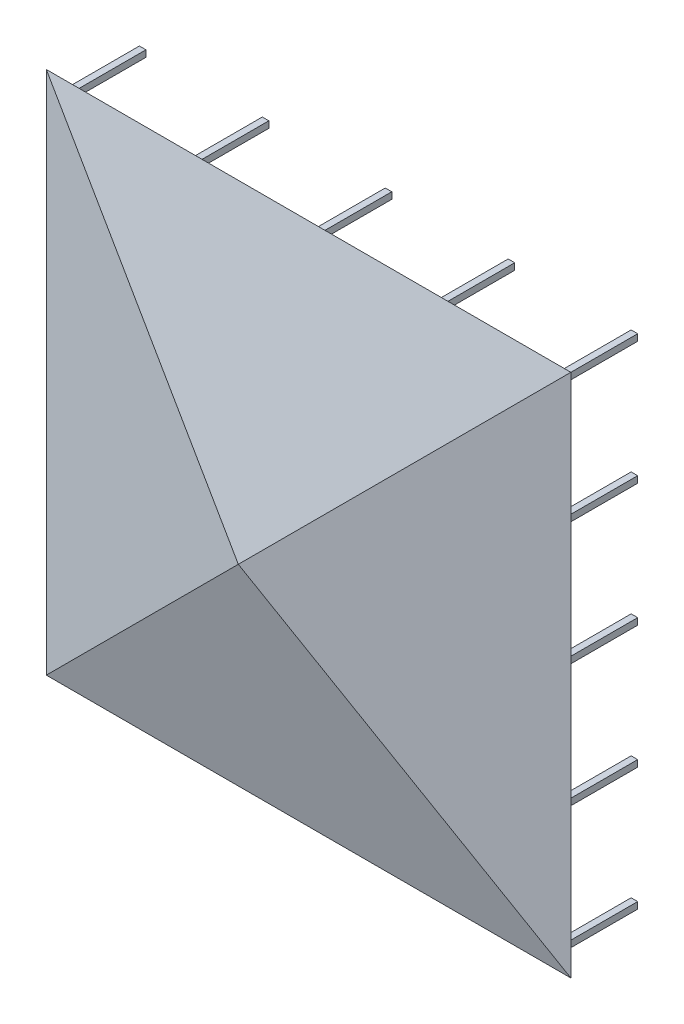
ISO-10303-21;
HEADER;
FILE_DESCRIPTION(('STEP AP214'),'2;1');
FILE_NAME('part.step','',(''),(''),'','','');
FILE_SCHEMA(('AUTOMOTIVE_DESIGN { 1 0 10303 214 1 1 1 1 }'));
ENDSEC;
DATA;
#1=APPLICATION_CONTEXT('core data for automotive mechanical design processes');
#2=APPLICATION_PROTOCOL_DEFINITION('international standard','automotive_design',2000,#1);
#3=PRODUCT_CONTEXT('',#1,'mechanical');
#4=PRODUCT('Part','Part','',(#3));
#5=PRODUCT_RELATED_PRODUCT_CATEGORY('part','',(#4));
#6=PRODUCT_DEFINITION_FORMATION('','',#4);
#7=PRODUCT_DEFINITION_CONTEXT('part definition',#1,'design');
#8=PRODUCT_DEFINITION('design','',#6,#7);
#9=PRODUCT_DEFINITION_SHAPE('','',#8);
#10=(LENGTH_UNIT() NAMED_UNIT(*) SI_UNIT(.MILLI.,.METRE.));
#11=(NAMED_UNIT(*) PLANE_ANGLE_UNIT() SI_UNIT($,.RADIAN.));
#12=(NAMED_UNIT(*) SI_UNIT($,.STERADIAN.) SOLID_ANGLE_UNIT());
#13=UNCERTAINTY_MEASURE_WITH_UNIT(LENGTH_MEASURE(1.E-05),#10,'distance_accuracy_value','');
#14=(GEOMETRIC_REPRESENTATION_CONTEXT(3) GLOBAL_UNCERTAINTY_ASSIGNED_CONTEXT((#13)) GLOBAL_UNIT_ASSIGNED_CONTEXT((#10,
#11,#12)) REPRESENTATION_CONTEXT('',''));
#15=CARTESIAN_POINT('',(0.,0.,0.));
#16=DIRECTION('',(0.,0.,1.));
#17=DIRECTION('',(1.,0.,0.));
#18=AXIS2_PLACEMENT_3D('',#15,#16,#17);
#19=CARTESIAN_POINT('',(7600.,-7400.,2438.4));
#20=DIRECTION('',(0.,-1.,0.));
#21=DIRECTION('',(1.,0.,0.));
#22=AXIS2_PLACEMENT_3D('',#19,#20,#21);
#23=PLANE('',#22);
#24=DIRECTION('',(-1.,0.,0.));
#25=VECTOR('',#24,1.);
#26=CARTESIAN_POINT('',(7600.,-7400.,0.));
#27=LINE('',#26,#25);
#28=CARTESIAN_POINT('',(7600.,-7400.,0.));
#29=VERTEX_POINT('',#28);
#30=CARTESIAN_POINT('',(7400.,-7400.,0.));
#31=VERTEX_POINT('',#30);
#32=EDGE_CURVE('E12',#29,#31,#27,.T.);
#33=ORIENTED_EDGE('',*,*,#32,.T.);
#34=DIRECTION('',(0.,0.,-1.));
#35=VECTOR('',#34,1.);
#36=CARTESIAN_POINT('',(7400.,-7400.,2438.4));
#37=LINE('',#36,#35);
#38=CARTESIAN_POINT('',(7400.,-7400.,2438.4));
#39=VERTEX_POINT('',#38);
#40=EDGE_CURVE('E126',#39,#31,#37,.T.);
#41=ORIENTED_EDGE('',*,*,#40,.F.);
#42=DIRECTION('',(-1.,0.,0.));
#43=VECTOR('',#42,1.);
#44=CARTESIAN_POINT('',(7600.,-7400.,2438.4));
#45=LINE('',#44,#43);
#46=CARTESIAN_POINT('',(7600.,-7400.,2438.4));
#47=VERTEX_POINT('',#46);
#48=EDGE_CURVE('E61',#47,#39,#45,.T.);
#49=ORIENTED_EDGE('',*,*,#48,.F.);
#50=DIRECTION('',(0.,0.,-1.));
#51=VECTOR('',#50,1.);
#52=CARTESIAN_POINT('',(7600.,-7400.,2438.4));
#53=LINE('',#52,#51);
#54=EDGE_CURVE('E116',#47,#29,#53,.T.);
#55=ORIENTED_EDGE('',*,*,#54,.T.);
#56=EDGE_LOOP('',(#33,#41,#49,#55));
#57=FACE_BOUND('',#56,.T.);
#58=ADVANCED_FACE('F60',(#57),#23,.F.);
#59=CARTESIAN_POINT('',(7400.,-7600.,2438.4));
#60=DIRECTION('',(1.,0.,0.));
#61=DIRECTION('',(0.,0.,-1.));
#62=AXIS2_PLACEMENT_3D('',#59,#60,#61);
#63=PLANE('',#62);
#64=DIRECTION('',(0.,-1.,0.));
#65=VECTOR('',#64,1.);
#66=CARTESIAN_POINT('',(7400.,-7600.,0.));
#67=LINE('',#66,#65);
#68=CARTESIAN_POINT('',(7400.,-7600.,0.));
#69=VERTEX_POINT('',#68);
#70=EDGE_CURVE('E69',#31,#69,#67,.T.);
#71=ORIENTED_EDGE('',*,*,#70,.T.);
#72=DIRECTION('',(0.,0.,-1.));
#73=VECTOR('',#72,1.);
#74=CARTESIAN_POINT('',(7400.,-7600.,2438.4));
#75=LINE('',#74,#73);
#76=CARTESIAN_POINT('',(7400.,-7600.,2438.4));
#77=VERTEX_POINT('',#76);
#78=EDGE_CURVE('E115',#77,#69,#75,.T.);
#79=ORIENTED_EDGE('',*,*,#78,.F.);
#80=DIRECTION('',(0.,-1.,0.));
#81=VECTOR('',#80,1.);
#82=CARTESIAN_POINT('',(7400.,-7600.,2438.4));
#83=LINE('',#82,#81);
#84=EDGE_CURVE('E93',#39,#77,#83,.T.);
#85=ORIENTED_EDGE('',*,*,#84,.F.);
#86=ORIENTED_EDGE('',*,*,#40,.T.);
#87=EDGE_LOOP('',(#71,#79,#85,#86));
#88=FACE_BOUND('',#87,.T.);
#89=ADVANCED_FACE('F131',(#88),#63,.F.);
#90=CARTESIAN_POINT('',(7600.,-7600.,2438.4));
#91=DIRECTION('',(0.,1.,0.));
#92=DIRECTION('',(0.,0.,1.));
#93=AXIS2_PLACEMENT_3D('',#90,#91,#92);
#94=PLANE('',#93);
#95=DIRECTION('',(1.,0.,0.));
#96=VECTOR('',#95,1.);
#97=CARTESIAN_POINT('',(7600.,-7600.,0.));
#98=LINE('',#97,#96);
#99=CARTESIAN_POINT('',(7600.,-7600.,0.));
#100=VERTEX_POINT('',#99);
#101=EDGE_CURVE('E110',#69,#100,#98,.T.);
#102=ORIENTED_EDGE('',*,*,#101,.T.);
#103=DIRECTION('',(0.,0.,-1.));
#104=VECTOR('',#103,1.);
#105=CARTESIAN_POINT('',(7600.,-7600.,2438.4));
#106=LINE('',#105,#104);
#107=CARTESIAN_POINT('',(7600.,-7600.,2438.4));
#108=VERTEX_POINT('',#107);
#109=EDGE_CURVE('E109',#108,#100,#106,.T.);
#110=ORIENTED_EDGE('',*,*,#109,.F.);
#111=DIRECTION('',(1.,0.,0.));
#112=VECTOR('',#111,1.);
#113=CARTESIAN_POINT('',(7600.,-7600.,2438.4));
#114=LINE('',#113,#112);
#115=EDGE_CURVE('E125',#77,#108,#114,.T.);
#116=ORIENTED_EDGE('',*,*,#115,.F.);
#117=ORIENTED_EDGE('',*,*,#78,.T.);
#118=EDGE_LOOP('',(#102,#110,#116,#117));
#119=FACE_BOUND('',#118,.T.);
#120=ADVANCED_FACE('F107',(#119),#94,.F.);
#121=CARTESIAN_POINT('',(7600.,-7600.,2438.4));
#122=DIRECTION('',(-1.,0.,0.));
#123=DIRECTION('',(0.,-1.,0.));
#124=AXIS2_PLACEMENT_3D('',#121,#122,#123);
#125=PLANE('',#124);
#126=DIRECTION('',(0.,1.,0.));
#127=VECTOR('',#126,1.);
#128=CARTESIAN_POINT('',(7600.,-7600.,0.));
#129=LINE('',#128,#127);
#130=EDGE_CURVE('E101',#100,#29,#129,.T.);
#131=ORIENTED_EDGE('',*,*,#130,.T.);
#132=ORIENTED_EDGE('',*,*,#54,.F.);
#133=DIRECTION('',(0.,1.,0.));
#134=VECTOR('',#133,1.);
#135=CARTESIAN_POINT('',(7600.,-7600.,2438.4));
#136=LINE('',#135,#134);
#137=EDGE_CURVE('E113',#108,#47,#136,.T.);
#138=ORIENTED_EDGE('',*,*,#137,.F.);
#139=ORIENTED_EDGE('',*,*,#109,.T.);
#140=EDGE_LOOP('',(#131,#132,#138,#139));
#141=FACE_BOUND('',#140,.T.);
#142=ADVANCED_FACE('F111',(#141),#125,.F.);
#143=CARTESIAN_POINT('',(0.,0.,2438.4));
#144=DIRECTION('',(0.,0.,-1.));
#145=DIRECTION('',(-1.,0.,0.));
#146=AXIS2_PLACEMENT_3D('',#143,#144,#145);
#147=PLANE('',#146);
#148=ORIENTED_EDGE('',*,*,#48,.T.);
#149=ORIENTED_EDGE('',*,*,#84,.T.);
#150=ORIENTED_EDGE('',*,*,#115,.T.);
#151=ORIENTED_EDGE('',*,*,#137,.T.);
#152=EDGE_LOOP('',(#148,#149,#150,#151));
#153=FACE_BOUND('',#152,.T.);
#154=ADVANCED_FACE('F56',(#153),#147,.F.);
#155=CARTESIAN_POINT('',(0.,0.,0.));
#156=DIRECTION('',(0.,0.,-1.));
#157=DIRECTION('',(-1.,0.,0.));
#158=AXIS2_PLACEMENT_3D('',#155,#156,#157);
#159=PLANE('',#158);
#160=ORIENTED_EDGE('',*,*,#32,.F.);
#161=ORIENTED_EDGE('',*,*,#130,.F.);
#162=ORIENTED_EDGE('',*,*,#101,.F.);
#163=ORIENTED_EDGE('',*,*,#70,.F.);
#164=EDGE_LOOP('',(#160,#161,#162,#163));
#165=FACE_BOUND('',#164,.T.);
#166=ADVANCED_FACE('F117',(#165),#159,.T.);
#167=CLOSED_SHELL('',(#58,#89,#120,#142,#154,#166));
#168=MANIFOLD_SOLID_BREP('B2_NOT_SHOWN',#167);
#169=CARTESIAN_POINT('',(0.,0.,2438.4));
#170=DIRECTION('',(0.,0.,1.));
#171=DIRECTION('',(1.,0.,0.));
#172=AXIS2_PLACEMENT_3D('',#169,#170,#171);
#173=PLANE('',#172);
#174=DIRECTION('',(-1.,0.,0.));
#175=VECTOR('',#174,1.);
#176=CARTESIAN_POINT('',(-3650.,-7400.00000000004,2438.4));
#177=LINE('',#176,#175);
#178=CARTESIAN_POINT('',(-3650.,-7400.00000000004,2438.4));
#179=VERTEX_POINT('',#178);
#180=CARTESIAN_POINT('',(-3850.,-7400.00000000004,2438.4));
#181=VERTEX_POINT('',#180);
#182=EDGE_CURVE('E632',#179,#181,#177,.T.);
#183=ORIENTED_EDGE('',*,*,#182,.T.);
#184=DIRECTION('',(0.,-1.,0.));
#185=VECTOR('',#184,1.);
#186=CARTESIAN_POINT('',(-3850.,-7600.00000000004,2438.4));
#187=LINE('',#186,#185);
#188=CARTESIAN_POINT('',(-3850.,-7600.00000000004,2438.4));
#189=VERTEX_POINT('',#188);
#190=EDGE_CURVE('E647',#181,#189,#187,.T.);
#191=ORIENTED_EDGE('',*,*,#190,.T.);
#192=DIRECTION('',(1.,0.,0.));
#193=VECTOR('',#192,1.);
#194=CARTESIAN_POINT('',(-3650.,-7600.00000000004,2438.4));
#195=LINE('',#194,#193);
#196=CARTESIAN_POINT('',(-3650.,-7600.00000000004,2438.4));
#197=VERTEX_POINT('',#196);
#198=EDGE_CURVE('E646',#189,#197,#195,.T.);
#199=ORIENTED_EDGE('',*,*,#198,.T.);
#200=DIRECTION('',(0.,1.,0.));
#201=VECTOR('',#200,1.);
#202=CARTESIAN_POINT('',(-3650.,-7600.00000000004,2438.4));
#203=LINE('',#202,#201);
#204=EDGE_CURVE('E627',#197,#179,#203,.T.);
#205=ORIENTED_EDGE('',*,*,#204,.T.);
#206=EDGE_LOOP('',(#183,#191,#199,#205));
#207=FACE_BOUND('',#206,.T.);
#208=DIRECTION('',(-1.,0.,0.));
#209=VECTOR('',#208,1.);
#210=CARTESIAN_POINT('',(3850.,-7400.00000000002,2438.4));
#211=LINE('',#210,#209);
#212=CARTESIAN_POINT('',(3850.,-7400.00000000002,2438.4));
#213=VERTEX_POINT('',#212);
#214=CARTESIAN_POINT('',(3650.,-7400.00000000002,2438.4));
#215=VERTEX_POINT('',#214);
#216=EDGE_CURVE('E714',#213,#215,#211,.T.);
#217=ORIENTED_EDGE('',*,*,#216,.T.);
#218=DIRECTION('',(0.,-1.,0.));
#219=VECTOR('',#218,1.);
#220=CARTESIAN_POINT('',(3650.,-7600.00000000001,2438.4));
#221=LINE('',#220,#219);
#222=CARTESIAN_POINT('',(3650.,-7600.00000000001,2438.4));
#223=VERTEX_POINT('',#222);
#224=EDGE_CURVE('E732',#215,#223,#221,.T.);
#225=ORIENTED_EDGE('',*,*,#224,.T.);
#226=DIRECTION('',(1.,0.,0.));
#227=VECTOR('',#226,1.);
#228=CARTESIAN_POINT('',(3850.,-7600.00000000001,2438.4));
#229=LINE('',#228,#227);
#230=CARTESIAN_POINT('',(3850.,-7600.00000000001,2438.4));
#231=VERTEX_POINT('',#230);
#232=EDGE_CURVE('E727',#223,#231,#229,.T.);
#233=ORIENTED_EDGE('',*,*,#232,.T.);
#234=DIRECTION('',(0.,1.,0.));
#235=VECTOR('',#234,1.);
#236=CARTESIAN_POINT('',(3850.,-7600.00000000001,2438.4));
#237=LINE('',#236,#235);
#238=EDGE_CURVE('E709',#231,#213,#237,.T.);
#239=ORIENTED_EDGE('',*,*,#238,.T.);
#240=EDGE_LOOP('',(#217,#225,#233,#239));
#241=FACE_BOUND('',#240,.T.);
#242=DIRECTION('',(-1.,0.,0.));
#243=VECTOR('',#242,1.);
#244=CARTESIAN_POINT('',(-7400.,3849.99999999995,2438.4));
#245=LINE('',#244,#243);
#246=CARTESIAN_POINT('',(-7400.,3849.99999999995,2438.4));
#247=VERTEX_POINT('',#246);
#248=CARTESIAN_POINT('',(-7600.,3849.99999999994,2438.4));
#249=VERTEX_POINT('',#248);
#250=EDGE_CURVE('E799',#247,#249,#245,.T.);
#251=ORIENTED_EDGE('',*,*,#250,.T.);
#252=DIRECTION('',(0.,-1.,0.));
#253=VECTOR('',#252,1.);
#254=CARTESIAN_POINT('',(-7600.,3649.99999999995,2438.4));
#255=LINE('',#254,#253);
#256=CARTESIAN_POINT('',(-7600.,3649.99999999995,2438.4));
#257=VERTEX_POINT('',#256);
#258=EDGE_CURVE('E813',#249,#257,#255,.T.);
#259=ORIENTED_EDGE('',*,*,#258,.T.);
#260=DIRECTION('',(1.,0.,0.));
#261=VECTOR('',#260,1.);
#262=CARTESIAN_POINT('',(-7400.,3649.99999999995,2438.4));
#263=LINE('',#262,#261);
#264=CARTESIAN_POINT('',(-7400.,3649.99999999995,2438.4));
#265=VERTEX_POINT('',#264);
#266=EDGE_CURVE('E807',#257,#265,#263,.T.);
#267=ORIENTED_EDGE('',*,*,#266,.T.);
#268=DIRECTION('',(0.,1.,0.));
#269=VECTOR('',#268,1.);
#270=CARTESIAN_POINT('',(-7400.,3649.99999999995,2438.4));
#271=LINE('',#270,#269);
#272=EDGE_CURVE('E795',#265,#247,#271,.T.);
#273=ORIENTED_EDGE('',*,*,#272,.T.);
#274=EDGE_LOOP('',(#251,#259,#267,#273));
#275=FACE_BOUND('',#274,.T.);
#276=DIRECTION('',(-1.,0.,0.));
#277=VECTOR('',#276,1.);
#278=CARTESIAN_POINT('',(-7400.,-3650.00000000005,2438.4));
#279=LINE('',#278,#277);
#280=CARTESIAN_POINT('',(-7400.,-3650.00000000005,2438.4));
#281=VERTEX_POINT('',#280);
#282=CARTESIAN_POINT('',(-7600.,-3650.00000000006,2438.4));
#283=VERTEX_POINT('',#282);
#284=EDGE_CURVE('E878',#281,#283,#279,.T.);
#285=ORIENTED_EDGE('',*,*,#284,.T.);
#286=DIRECTION('',(0.,-1.,0.));
#287=VECTOR('',#286,1.);
#288=CARTESIAN_POINT('',(-7600.,-3850.00000000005,2438.4));
#289=LINE('',#288,#287);
#290=CARTESIAN_POINT('',(-7600.,-3850.00000000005,2438.4));
#291=VERTEX_POINT('',#290);
#292=EDGE_CURVE('E891',#283,#291,#289,.T.);
#293=ORIENTED_EDGE('',*,*,#292,.T.);
#294=DIRECTION('',(1.,0.,0.));
#295=VECTOR('',#294,1.);
#296=CARTESIAN_POINT('',(-7400.,-3850.00000000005,2438.4));
#297=LINE('',#296,#295);
#298=CARTESIAN_POINT('',(-7400.,-3850.00000000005,2438.4));
#299=VERTEX_POINT('',#298);
#300=EDGE_CURVE('E894',#291,#299,#297,.T.);
#301=ORIENTED_EDGE('',*,*,#300,.T.);
#302=DIRECTION('',(0.,1.,0.));
#303=VECTOR('',#302,1.);
#304=CARTESIAN_POINT('',(-7400.,-3850.00000000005,2438.4));
#305=LINE('',#304,#303);
#306=EDGE_CURVE('E872',#299,#281,#305,.T.);
#307=ORIENTED_EDGE('',*,*,#306,.T.);
#308=EDGE_LOOP('',(#285,#293,#301,#307));
#309=FACE_BOUND('',#308,.T.);
#310=DIRECTION('',(-1.,0.,0.));
#311=VECTOR('',#310,1.);
#312=CARTESIAN_POINT('',(100.000000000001,7599.99999999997,2438.4));
#313=LINE('',#312,#311);
#314=CARTESIAN_POINT('',(100.000000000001,7599.99999999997,2438.4));
#315=VERTEX_POINT('',#314);
#316=CARTESIAN_POINT('',(-99.9999999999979,7599.99999999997,2438.4));
#317=VERTEX_POINT('',#316);
#318=EDGE_CURVE('E963',#315,#317,#313,.T.);
#319=ORIENTED_EDGE('',*,*,#318,.T.);
#320=DIRECTION('',(0.,-1.,0.));
#321=VECTOR('',#320,1.);
#322=CARTESIAN_POINT('',(-99.9999999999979,7399.99999999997,2438.4));
#323=LINE('',#322,#321);
#324=CARTESIAN_POINT('',(-99.9999999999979,7399.99999999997,2438.4));
#325=VERTEX_POINT('',#324);
#326=EDGE_CURVE('E980',#317,#325,#323,.T.);
#327=ORIENTED_EDGE('',*,*,#326,.T.);
#328=DIRECTION('',(1.,0.,0.));
#329=VECTOR('',#328,1.);
#330=CARTESIAN_POINT('',(100.000000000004,7399.99999999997,2438.4));
#331=LINE('',#330,#329);
#332=CARTESIAN_POINT('',(100.000000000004,7399.99999999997,2438.4));
#333=VERTEX_POINT('',#332);
#334=EDGE_CURVE('E974',#325,#333,#331,.T.);
#335=ORIENTED_EDGE('',*,*,#334,.T.);
#336=DIRECTION('',(0.,1.,0.));
#337=VECTOR('',#336,1.);
#338=CARTESIAN_POINT('',(100.000000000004,7399.99999999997,2438.4));
#339=LINE('',#338,#337);
#340=EDGE_CURVE('E956',#333,#315,#339,.T.);
#341=ORIENTED_EDGE('',*,*,#340,.T.);
#342=EDGE_LOOP('',(#319,#327,#335,#341));
#343=FACE_BOUND('',#342,.T.);
#344=DIRECTION('',(-1.,0.,0.));
#345=VECTOR('',#344,1.);
#346=CARTESIAN_POINT('',(7600.,7600.,2438.4));
#347=LINE('',#346,#345);
#348=CARTESIAN_POINT('',(7600.,7600.,2438.4));
#349=VERTEX_POINT('',#348);
#350=CARTESIAN_POINT('',(7400.,7600.,2438.4));
#351=VERTEX_POINT('',#350);
#352=EDGE_CURVE('E1042',#349,#351,#347,.T.);
#353=ORIENTED_EDGE('',*,*,#352,.T.);
#354=DIRECTION('',(0.,-1.,0.));
#355=VECTOR('',#354,1.);
#356=CARTESIAN_POINT('',(7400.,7400.,2438.4));
#357=LINE('',#356,#355);
#358=CARTESIAN_POINT('',(7400.,7400.,2438.4));
#359=VERTEX_POINT('',#358);
#360=EDGE_CURVE('E1060',#351,#359,#357,.T.);
#361=ORIENTED_EDGE('',*,*,#360,.T.);
#362=DIRECTION('',(1.,0.,0.));
#363=VECTOR('',#362,1.);
#364=CARTESIAN_POINT('',(7600.,7400.,2438.4));
#365=LINE('',#364,#363);
#366=CARTESIAN_POINT('',(7600.,7400.,2438.4));
#367=VERTEX_POINT('',#366);
#368=EDGE_CURVE('E1058',#359,#367,#365,.T.);
#369=ORIENTED_EDGE('',*,*,#368,.T.);
#370=DIRECTION('',(0.,1.,0.));
#371=VECTOR('',#370,1.);
#372=CARTESIAN_POINT('',(7600.,7400.,2438.4));
#373=LINE('',#372,#371);
#374=EDGE_CURVE('E1038',#367,#349,#373,.T.);
#375=ORIENTED_EDGE('',*,*,#374,.T.);
#376=EDGE_LOOP('',(#353,#361,#369,#375));
#377=FACE_BOUND('',#376,.T.);
#378=DIRECTION('',(-1.,0.,0.));
#379=VECTOR('',#378,1.);
#380=CARTESIAN_POINT('',(7600.,99.999999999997,2438.4));
#381=LINE('',#380,#379);
#382=CARTESIAN_POINT('',(7600.,99.999999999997,2438.4));
#383=VERTEX_POINT('',#382);
#384=CARTESIAN_POINT('',(7400.,99.9999999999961,2438.4));
#385=VERTEX_POINT('',#384);
#386=EDGE_CURVE('E1124',#383,#385,#381,.T.);
#387=ORIENTED_EDGE('',*,*,#386,.T.);
#388=DIRECTION('',(0.,-1.,0.));
#389=VECTOR('',#388,1.);
#390=CARTESIAN_POINT('',(7400.,-100.000000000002,2438.4));
#391=LINE('',#390,#389);
#392=CARTESIAN_POINT('',(7400.,-100.000000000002,2438.4));
#393=VERTEX_POINT('',#392);
#394=EDGE_CURVE('E1141',#385,#393,#391,.T.);
#395=ORIENTED_EDGE('',*,*,#394,.T.);
#396=DIRECTION('',(1.,0.,0.));
#397=VECTOR('',#396,1.);
#398=CARTESIAN_POINT('',(7600.,-100.000000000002,2438.4));
#399=LINE('',#398,#397);
#400=CARTESIAN_POINT('',(7600.,-100.000000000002,2438.4));
#401=VERTEX_POINT('',#400);
#402=EDGE_CURVE('E1136',#393,#401,#399,.T.);
#403=ORIENTED_EDGE('',*,*,#402,.T.);
#404=DIRECTION('',(0.,1.,0.));
#405=VECTOR('',#404,1.);
#406=CARTESIAN_POINT('',(7600.,-100.000000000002,2438.4));
#407=LINE('',#406,#405);
#408=EDGE_CURVE('E1118',#401,#383,#407,.T.);
#409=ORIENTED_EDGE('',*,*,#408,.T.);
#410=EDGE_LOOP('',(#387,#395,#403,#409));
#411=FACE_BOUND('',#410,.T.);
#412=DIRECTION('',(0.,-1.,0.));
#413=VECTOR('',#412,1.);
#414=CARTESIAN_POINT('',(-8000.,7999.99999999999,2438.4));
#415=LINE('',#414,#413);
#416=CARTESIAN_POINT('',(-8000.,7999.99999999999,2438.4));
#417=VERTEX_POINT('',#416);
#418=CARTESIAN_POINT('',(-8000.,-8000.00000000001,2438.4));
#419=VERTEX_POINT('',#418);
#420=EDGE_CURVE('E1134',#417,#419,#415,.T.);
#421=ORIENTED_EDGE('',*,*,#420,.F.);
#422=DIRECTION('',(-1.,0.,0.));
#423=VECTOR('',#422,1.);
#424=CARTESIAN_POINT('',(8000.,8000.,2438.4));
#425=LINE('',#424,#423);
#426=CARTESIAN_POINT('',(8000.,8000.,2438.4));
#427=VERTEX_POINT('',#426);
#428=EDGE_CURVE('E1160',#427,#417,#425,.T.);
#429=ORIENTED_EDGE('',*,*,#428,.F.);
#430=DIRECTION('',(0.,1.,0.));
#431=VECTOR('',#430,1.);
#432=CARTESIAN_POINT('',(8000.,-8000.,2438.4));
#433=LINE('',#432,#431);
#434=CARTESIAN_POINT('',(8000.,-8000.,2438.4));
#435=VERTEX_POINT('',#434);
#436=EDGE_CURVE('E1152',#435,#427,#433,.T.);
#437=ORIENTED_EDGE('',*,*,#436,.F.);
#438=DIRECTION('',(1.,0.,0.));
#439=VECTOR('',#438,1.);
#440=CARTESIAN_POINT('',(-8000.,-8000.00000000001,2438.4));
#441=LINE('',#440,#439);
#442=EDGE_CURVE('E1147',#419,#435,#441,.T.);
#443=ORIENTED_EDGE('',*,*,#442,.F.);
#444=EDGE_LOOP('',(#421,#429,#437,#443));
#445=FACE_BOUND('',#444,.T.);
#446=DIRECTION('',(0.,1.,0.));
#447=VECTOR('',#446,1.);
#448=CARTESIAN_POINT('',(7600.,-3850.,2438.4));
#449=LINE('',#448,#447);
#450=CARTESIAN_POINT('',(7600.,-3850.,2438.4));
#451=VERTEX_POINT('',#450);
#452=CARTESIAN_POINT('',(7600.,-3650.,2438.4));
#453=VERTEX_POINT('',#452);
#454=EDGE_CURVE('E1186',#451,#453,#449,.T.);
#455=ORIENTED_EDGE('',*,*,#454,.T.);
#456=DIRECTION('',(-1.,0.,0.));
#457=VECTOR('',#456,1.);
#458=CARTESIAN_POINT('',(7600.,-3650.,2438.4));
#459=LINE('',#458,#457);
#460=CARTESIAN_POINT('',(7400.,-3650.,2438.4));
#461=VERTEX_POINT('',#460);
#462=EDGE_CURVE('E1173',#453,#461,#459,.T.);
#463=ORIENTED_EDGE('',*,*,#462,.T.);
#464=DIRECTION('',(0.,-1.,0.));
#465=VECTOR('',#464,1.);
#466=CARTESIAN_POINT('',(7400.,-3850.,2438.4));
#467=LINE('',#466,#465);
#468=CARTESIAN_POINT('',(7400.,-3850.,2438.4));
#469=VERTEX_POINT('',#468);
#470=EDGE_CURVE('E1178',#461,#469,#467,.T.);
#471=ORIENTED_EDGE('',*,*,#470,.T.);
#472=DIRECTION('',(1.,0.,0.));
#473=VECTOR('',#472,1.);
#474=CARTESIAN_POINT('',(7600.,-3850.,2438.4));
#475=LINE('',#474,#473);
#476=EDGE_CURVE('E1185',#469,#451,#475,.T.);
#477=ORIENTED_EDGE('',*,*,#476,.T.);
#478=EDGE_LOOP('',(#455,#463,#471,#477));
#479=FACE_BOUND('',#478,.T.);
#480=DIRECTION('',(-1.,0.,0.));
#481=VECTOR('',#480,1.);
#482=CARTESIAN_POINT('',(7600.,3850.,2438.4));
#483=LINE('',#482,#481);
#484=CARTESIAN_POINT('',(7600.,3850.,2438.4));
#485=VERTEX_POINT('',#484);
#486=CARTESIAN_POINT('',(7400.,3850.,2438.4));
#487=VERTEX_POINT('',#486);
#488=EDGE_CURVE('E1084',#485,#487,#483,.T.);
#489=ORIENTED_EDGE('',*,*,#488,.T.);
#490=DIRECTION('',(0.,-1.,0.));
#491=VECTOR('',#490,1.);
#492=CARTESIAN_POINT('',(7400.,3650.,2438.4));
#493=LINE('',#492,#491);
#494=CARTESIAN_POINT('',(7400.,3650.,2438.4));
#495=VERTEX_POINT('',#494);
#496=EDGE_CURVE('E1099',#487,#495,#493,.T.);
#497=ORIENTED_EDGE('',*,*,#496,.T.);
#498=DIRECTION('',(1.,0.,0.));
#499=VECTOR('',#498,1.);
#500=CARTESIAN_POINT('',(7600.,3650.,2438.4));
#501=LINE('',#500,#499);
#502=CARTESIAN_POINT('',(7600.,3650.,2438.4));
#503=VERTEX_POINT('',#502);
#504=EDGE_CURVE('E1100',#495,#503,#501,.T.);
#505=ORIENTED_EDGE('',*,*,#504,.T.);
#506=DIRECTION('',(0.,1.,0.));
#507=VECTOR('',#506,1.);
#508=CARTESIAN_POINT('',(7600.,3650.,2438.4));
#509=LINE('',#508,#507);
#510=EDGE_CURVE('E1080',#503,#485,#509,.T.);
#511=ORIENTED_EDGE('',*,*,#510,.T.);
#512=EDGE_LOOP('',(#489,#497,#505,#511));
#513=FACE_BOUND('',#512,.T.);
#514=DIRECTION('',(-1.,0.,0.));
#515=VECTOR('',#514,1.);
#516=CARTESIAN_POINT('',(3850.,7599.99999999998,2438.4));
#517=LINE('',#516,#515);
#518=CARTESIAN_POINT('',(3850.,7599.99999999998,2438.4));
#519=VERTEX_POINT('',#518);
#520=CARTESIAN_POINT('',(3650.,7599.99999999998,2438.4));
#521=VERTEX_POINT('',#520);
#522=EDGE_CURVE('E1004',#519,#521,#517,.T.);
#523=ORIENTED_EDGE('',*,*,#522,.T.);
#524=DIRECTION('',(0.,-1.,0.));
#525=VECTOR('',#524,1.);
#526=CARTESIAN_POINT('',(3650.,7399.99999999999,2438.4));
#527=LINE('',#526,#525);
#528=CARTESIAN_POINT('',(3650.,7399.99999999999,2438.4));
#529=VERTEX_POINT('',#528);
#530=EDGE_CURVE('E1017',#521,#529,#527,.T.);
#531=ORIENTED_EDGE('',*,*,#530,.T.);
#532=DIRECTION('',(1.,0.,0.));
#533=VECTOR('',#532,1.);
#534=CARTESIAN_POINT('',(3850.,7399.99999999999,2438.4));
#535=LINE('',#534,#533);
#536=CARTESIAN_POINT('',(3850.,7399.99999999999,2438.4));
#537=VERTEX_POINT('',#536);
#538=EDGE_CURVE('E1014',#529,#537,#535,.T.);
#539=ORIENTED_EDGE('',*,*,#538,.T.);
#540=DIRECTION('',(0.,1.,0.));
#541=VECTOR('',#540,1.);
#542=CARTESIAN_POINT('',(3850.,7399.99999999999,2438.4));
#543=LINE('',#542,#541);
#544=EDGE_CURVE('E1000',#537,#519,#543,.T.);
#545=ORIENTED_EDGE('',*,*,#544,.T.);
#546=EDGE_LOOP('',(#523,#531,#539,#545));
#547=FACE_BOUND('',#546,.T.);
#548=DIRECTION('',(-1.,0.,0.));
#549=VECTOR('',#548,1.);
#550=CARTESIAN_POINT('',(-3650.,7599.99999999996,2438.4));
#551=LINE('',#550,#549);
#552=CARTESIAN_POINT('',(-3650.,7599.99999999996,2438.4));
#553=VERTEX_POINT('',#552);
#554=CARTESIAN_POINT('',(-3850.,7599.99999999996,2438.4));
#555=VERTEX_POINT('',#554);
#556=EDGE_CURVE('E917',#553,#555,#551,.T.);
#557=ORIENTED_EDGE('',*,*,#556,.T.);
#558=DIRECTION('',(0.,-1.,0.));
#559=VECTOR('',#558,1.);
#560=CARTESIAN_POINT('',(-3850.,7399.99999999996,2438.4));
#561=LINE('',#560,#559);
#562=CARTESIAN_POINT('',(-3850.,7399.99999999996,2438.4));
#563=VERTEX_POINT('',#562);
#564=EDGE_CURVE('E937',#555,#563,#561,.T.);
#565=ORIENTED_EDGE('',*,*,#564,.T.);
#566=DIRECTION('',(1.,0.,0.));
#567=VECTOR('',#566,1.);
#568=CARTESIAN_POINT('',(-3650.,7399.99999999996,2438.4));
#569=LINE('',#568,#567);
#570=CARTESIAN_POINT('',(-3650.,7399.99999999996,2438.4));
#571=VERTEX_POINT('',#570);
#572=EDGE_CURVE('E932',#563,#571,#569,.T.);
#573=ORIENTED_EDGE('',*,*,#572,.T.);
#574=DIRECTION('',(0.,1.,0.));
#575=VECTOR('',#574,1.);
#576=CARTESIAN_POINT('',(-3650.,7399.99999999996,2438.4));
#577=LINE('',#576,#575);
#578=EDGE_CURVE('E914',#571,#553,#577,.T.);
#579=ORIENTED_EDGE('',*,*,#578,.T.);
#580=EDGE_LOOP('',(#557,#565,#573,#579));
#581=FACE_BOUND('',#580,.T.);
#582=DIRECTION('',(-1.,0.,0.));
#583=VECTOR('',#582,1.);
#584=CARTESIAN_POINT('',(-7400.,99.9999999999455,2438.4));
#585=LINE('',#584,#583);
#586=CARTESIAN_POINT('',(-7400.,99.9999999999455,2438.4));
#587=VERTEX_POINT('',#586);
#588=CARTESIAN_POINT('',(-7600.,99.9999999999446,2438.4));
#589=VERTEX_POINT('',#588);
#590=EDGE_CURVE('E837',#587,#589,#585,.T.);
#591=ORIENTED_EDGE('',*,*,#590,.T.);
#592=DIRECTION('',(0.,-1.,0.));
#593=VECTOR('',#592,1.);
#594=CARTESIAN_POINT('',(-7600.,-100.000000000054,2438.4));
#595=LINE('',#594,#593);
#596=CARTESIAN_POINT('',(-7600.,-100.000000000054,2438.4));
#597=VERTEX_POINT('',#596);
#598=EDGE_CURVE('E855',#589,#597,#595,.T.);
#599=ORIENTED_EDGE('',*,*,#598,.T.);
#600=DIRECTION('',(1.,0.,0.));
#601=VECTOR('',#600,1.);
#602=CARTESIAN_POINT('',(-7400.,-100.000000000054,2438.4));
#603=LINE('',#602,#601);
#604=CARTESIAN_POINT('',(-7400.,-100.000000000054,2438.4));
#605=VERTEX_POINT('',#604);
#606=EDGE_CURVE('E853',#597,#605,#603,.T.);
#607=ORIENTED_EDGE('',*,*,#606,.T.);
#608=DIRECTION('',(0.,1.,0.));
#609=VECTOR('',#608,1.);
#610=CARTESIAN_POINT('',(-7400.,-100.000000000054,2438.4));
#611=LINE('',#610,#609);
#612=EDGE_CURVE('E832',#605,#587,#611,.T.);
#613=ORIENTED_EDGE('',*,*,#612,.T.);
#614=EDGE_LOOP('',(#591,#599,#607,#613));
#615=FACE_BOUND('',#614,.T.);
#616=DIRECTION('',(-1.,0.,0.));
#617=VECTOR('',#616,1.);
#618=CARTESIAN_POINT('',(-7400.,7599.99999999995,2438.4));
#619=LINE('',#618,#617);
#620=CARTESIAN_POINT('',(-7400.,7599.99999999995,2438.4));
#621=VERTEX_POINT('',#620);
#622=CARTESIAN_POINT('',(-7600.,7599.99999999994,2438.4));
#623=VERTEX_POINT('',#622);
#624=EDGE_CURVE('E756',#621,#623,#619,.T.);
#625=ORIENTED_EDGE('',*,*,#624,.T.);
#626=DIRECTION('',(0.,-1.,0.));
#627=VECTOR('',#626,1.);
#628=CARTESIAN_POINT('',(-7600.,7399.99999999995,2438.4));
#629=LINE('',#628,#627);
#630=CARTESIAN_POINT('',(-7600.,7399.99999999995,2438.4));
#631=VERTEX_POINT('',#630);
#632=EDGE_CURVE('E775',#623,#631,#629,.T.);
#633=ORIENTED_EDGE('',*,*,#632,.T.);
#634=DIRECTION('',(1.,0.,0.));
#635=VECTOR('',#634,1.);
#636=CARTESIAN_POINT('',(-7400.,7399.99999999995,2438.4));
#637=LINE('',#636,#635);
#638=CARTESIAN_POINT('',(-7400.,7399.99999999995,2438.4));
#639=VERTEX_POINT('',#638);
#640=EDGE_CURVE('E768',#631,#639,#637,.T.);
#641=ORIENTED_EDGE('',*,*,#640,.T.);
#642=DIRECTION('',(0.,1.,0.));
#643=VECTOR('',#642,1.);
#644=CARTESIAN_POINT('',(-7400.,7399.99999999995,2438.4));
#645=LINE('',#644,#643);
#646=EDGE_CURVE('E753',#639,#621,#645,.T.);
#647=ORIENTED_EDGE('',*,*,#646,.T.);
#648=EDGE_LOOP('',(#625,#633,#641,#647));
#649=FACE_BOUND('',#648,.T.);
#650=DIRECTION('',(-1.,0.,0.));
#651=VECTOR('',#650,1.);
#652=CARTESIAN_POINT('',(100.000000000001,-7400.00000000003,2438.4));
#653=LINE('',#652,#651);
#654=CARTESIAN_POINT('',(100.000000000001,-7400.00000000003,2438.4));
#655=VERTEX_POINT('',#654);
#656=CARTESIAN_POINT('',(-99.9999999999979,-7400.00000000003,2438.4));
#657=VERTEX_POINT('',#656);
#658=EDGE_CURVE('E675',#655,#657,#653,.T.);
#659=ORIENTED_EDGE('',*,*,#658,.T.);
#660=DIRECTION('',(0.,-1.,0.));
#661=VECTOR('',#660,1.);
#662=CARTESIAN_POINT('',(-99.9999999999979,-7600.00000000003,2438.4));
#663=LINE('',#662,#661);
#664=CARTESIAN_POINT('',(-99.9999999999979,-7600.00000000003,2438.4));
#665=VERTEX_POINT('',#664);
#666=EDGE_CURVE('E686',#657,#665,#663,.T.);
#667=ORIENTED_EDGE('',*,*,#666,.T.);
#668=DIRECTION('',(1.,0.,0.));
#669=VECTOR('',#668,1.);
#670=CARTESIAN_POINT('',(100.000000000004,-7600.00000000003,2438.4));
#671=LINE('',#670,#669);
#672=CARTESIAN_POINT('',(100.000000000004,-7600.00000000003,2438.4));
#673=VERTEX_POINT('',#672);
#674=EDGE_CURVE('E689',#665,#673,#671,.T.);
#675=ORIENTED_EDGE('',*,*,#674,.T.);
#676=DIRECTION('',(0.,1.,0.));
#677=VECTOR('',#676,1.);
#678=CARTESIAN_POINT('',(100.000000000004,-7600.00000000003,2438.4));
#679=LINE('',#678,#677);
#680=EDGE_CURVE('E668',#673,#655,#679,.T.);
#681=ORIENTED_EDGE('',*,*,#680,.T.);
#682=EDGE_LOOP('',(#659,#667,#675,#681));
#683=FACE_BOUND('',#682,.T.);
#684=DIRECTION('',(-1.,0.,0.));
#685=VECTOR('',#684,1.);
#686=CARTESIAN_POINT('',(-7400.,-7400.00000000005,2438.4));
#687=LINE('',#686,#685);
#688=CARTESIAN_POINT('',(-7400.,-7400.00000000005,2438.4));
#689=VERTEX_POINT('',#688);
#690=CARTESIAN_POINT('',(-7600.,-7400.00000000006,2438.4));
#691=VERTEX_POINT('',#690);
#692=EDGE_CURVE('E197',#689,#691,#687,.T.);
#693=ORIENTED_EDGE('',*,*,#692,.T.);
#694=DIRECTION('',(0.,-1.,0.));
#695=VECTOR('',#694,1.);
#696=CARTESIAN_POINT('',(-7600.,-7600.00000000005,2438.4));
#697=LINE('',#696,#695);
#698=CARTESIAN_POINT('',(-7600.,-7600.00000000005,2438.4));
#699=VERTEX_POINT('',#698);
#700=EDGE_CURVE('E203',#691,#699,#697,.T.);
#701=ORIENTED_EDGE('',*,*,#700,.T.);
#702=DIRECTION('',(1.,0.,0.));
#703=VECTOR('',#702,1.);
#704=CARTESIAN_POINT('',(-7400.,-7600.00000000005,2438.4));
#705=LINE('',#704,#703);
#706=CARTESIAN_POINT('',(-7400.,-7600.00000000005,2438.4));
#707=VERTEX_POINT('',#706);
#708=EDGE_CURVE('E608',#699,#707,#705,.T.);
#709=ORIENTED_EDGE('',*,*,#708,.T.);
#710=DIRECTION('',(0.,1.,0.));
#711=VECTOR('',#710,1.);
#712=CARTESIAN_POINT('',(-7400.,-7600.00000000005,2438.4));
#713=LINE('',#712,#711);
#714=EDGE_CURVE('E595',#707,#689,#713,.T.);
#715=ORIENTED_EDGE('',*,*,#714,.T.);
#716=EDGE_LOOP('',(#693,#701,#709,#715));
#717=FACE_BOUND('',#716,.T.);
#718=ADVANCED_FACE('F182',(#207,#241,#275,#309,#343,#377,#411,#445,#479,#513,#547,#581,#615,
#649,#683,#717),#173,.F.);
#719=CARTESIAN_POINT('',(7600.,-3650.,2438.4));
#720=DIRECTION('',(0.,-1.,0.));
#721=DIRECTION('',(1.,0.,0.));
#722=AXIS2_PLACEMENT_3D('',#719,#720,#721);
#723=PLANE('',#722);
#724=DIRECTION('',(-1.,0.,0.));
#725=VECTOR('',#724,1.);
#726=CARTESIAN_POINT('',(7600.,-3650.,0.));
#727=LINE('',#726,#725);
#728=CARTESIAN_POINT('',(7600.,-3650.,0.));
#729=VERTEX_POINT('',#728);
#730=CARTESIAN_POINT('',(7400.,-3650.,0.));
#731=VERTEX_POINT('',#730);
#732=EDGE_CURVE('E1168',#729,#731,#727,.T.);
#733=ORIENTED_EDGE('',*,*,#732,.T.);
#734=DIRECTION('',(0.,0.,-1.));
#735=VECTOR('',#734,1.);
#736=CARTESIAN_POINT('',(7400.,-3650.,2438.4));
#737=LINE('',#736,#735);
#738=EDGE_CURVE('E54',#461,#731,#737,.T.);
#739=ORIENTED_EDGE('',*,*,#738,.F.);
#740=ORIENTED_EDGE('',*,*,#462,.F.);
#741=DIRECTION('',(0.,0.,-1.));
#742=VECTOR('',#741,1.);
#743=CARTESIAN_POINT('',(7600.,-3650.,2438.4));
#744=LINE('',#743,#742);
#745=EDGE_CURVE('E1195',#453,#729,#744,.T.);
#746=ORIENTED_EDGE('',*,*,#745,.T.);
#747=EDGE_LOOP('',(#733,#739,#740,#746));
#748=FACE_BOUND('',#747,.T.);
#749=ADVANCED_FACE('F181',(#748),#723,.F.);
#750=CARTESIAN_POINT('',(7400.,-3850.,2438.4));
#751=DIRECTION('',(1.,0.,0.));
#752=DIRECTION('',(0.,0.,-1.));
#753=AXIS2_PLACEMENT_3D('',#750,#751,#752);
#754=PLANE('',#753);
#755=DIRECTION('',(0.,-1.,0.));
#756=VECTOR('',#755,1.);
#757=CARTESIAN_POINT('',(7400.,-3850.,0.));
#758=LINE('',#757,#756);
#759=CARTESIAN_POINT('',(7400.,-3850.,0.));
#760=VERTEX_POINT('',#759);
#761=EDGE_CURVE('E1196',#731,#760,#758,.T.);
#762=ORIENTED_EDGE('',*,*,#761,.T.);
#763=DIRECTION('',(0.,0.,-1.));
#764=VECTOR('',#763,1.);
#765=CARTESIAN_POINT('',(7400.,-3850.,2438.4));
#766=LINE('',#765,#764);
#767=EDGE_CURVE('E189',#469,#760,#766,.T.);
#768=ORIENTED_EDGE('',*,*,#767,.F.);
#769=ORIENTED_EDGE('',*,*,#470,.F.);
#770=ORIENTED_EDGE('',*,*,#738,.T.);
#771=EDGE_LOOP('',(#762,#768,#769,#770));
#772=FACE_BOUND('',#771,.T.);
#773=ADVANCED_FACE('F1229',(#772),#754,.F.);
#774=CARTESIAN_POINT('',(7600.,-3850.,2438.4));
#775=DIRECTION('',(0.,1.,0.));
#776=DIRECTION('',(0.,0.,1.));
#777=AXIS2_PLACEMENT_3D('',#774,#775,#776);
#778=PLANE('',#777);
#779=DIRECTION('',(1.,0.,0.));
#780=VECTOR('',#779,1.);
#781=CARTESIAN_POINT('',(7600.,-3850.,0.));
#782=LINE('',#781,#780);
#783=CARTESIAN_POINT('',(7600.,-3850.,0.));
#784=VERTEX_POINT('',#783);
#785=EDGE_CURVE('E1197',#760,#784,#782,.T.);
#786=ORIENTED_EDGE('',*,*,#785,.T.);
#787=DIRECTION('',(0.,0.,-1.));
#788=VECTOR('',#787,1.);
#789=CARTESIAN_POINT('',(7600.,-3850.,2438.4));
#790=LINE('',#789,#788);
#791=EDGE_CURVE('E1210',#451,#784,#790,.T.);
#792=ORIENTED_EDGE('',*,*,#791,.F.);
#793=ORIENTED_EDGE('',*,*,#476,.F.);
#794=ORIENTED_EDGE('',*,*,#767,.T.);
#795=EDGE_LOOP('',(#786,#792,#793,#794));
#796=FACE_BOUND('',#795,.T.);
#797=ADVANCED_FACE('F1213',(#796),#778,.F.);
#798=CARTESIAN_POINT('',(7600.,-3850.,2438.4));
#799=DIRECTION('',(-1.,0.,0.));
#800=DIRECTION('',(0.,-1.,0.));
#801=AXIS2_PLACEMENT_3D('',#798,#799,#800);
#802=PLANE('',#801);
#803=DIRECTION('',(0.,1.,0.));
#804=VECTOR('',#803,1.);
#805=CARTESIAN_POINT('',(7600.,-3850.,0.));
#806=LINE('',#805,#804);
#807=EDGE_CURVE('E1179',#784,#729,#806,.T.);
#808=ORIENTED_EDGE('',*,*,#807,.T.);
#809=ORIENTED_EDGE('',*,*,#745,.F.);
#810=ORIENTED_EDGE('',*,*,#454,.F.);
#811=ORIENTED_EDGE('',*,*,#791,.T.);
#812=EDGE_LOOP('',(#808,#809,#810,#811));
#813=FACE_BOUND('',#812,.T.);
#814=ADVANCED_FACE('F1222',(#813),#802,.F.);
#815=CARTESIAN_POINT('',(0.,0.,0.));
#816=DIRECTION('',(0.,0.,-1.));
#817=DIRECTION('',(-1.,0.,0.));
#818=AXIS2_PLACEMENT_3D('',#815,#816,#817);
#819=PLANE('',#818);
#820=ORIENTED_EDGE('',*,*,#732,.F.);
#821=ORIENTED_EDGE('',*,*,#807,.F.);
#822=ORIENTED_EDGE('',*,*,#785,.F.);
#823=ORIENTED_EDGE('',*,*,#761,.F.);
#824=EDGE_LOOP('',(#820,#821,#822,#823));
#825=FACE_BOUND('',#824,.T.);
#826=ADVANCED_FACE('F1219',(#825),#819,.T.);
#827=CARTESIAN_POINT('',(-8000.,7999.99999999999,2438.4));
#828=DIRECTION('',(-0.258819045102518,0.,0.965925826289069));
#829=DIRECTION('',(0.965925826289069,0.,0.258819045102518));
#830=AXIS2_PLACEMENT_3D('',#827,#828,#829);
#831=PLANE('',#830);
#832=ORIENTED_EDGE('',*,*,#420,.T.);
#833=DIRECTION('',(-0.694746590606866,-0.694746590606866,-0.186156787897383));
#834=VECTOR('',#833,1.);
#835=CARTESIAN_POINT('',(-8000.,-8000.00000000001,2438.4));
#836=LINE('',#835,#834);
#837=CARTESIAN_POINT('',(2.1094237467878E-12,-4.21884749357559E-12,4581.99353944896));
#838=VERTEX_POINT('',#837);
#839=EDGE_CURVE('E1165',#838,#419,#836,.T.);
#840=ORIENTED_EDGE('',*,*,#839,.F.);
#841=DIRECTION('',(-0.694746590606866,0.694746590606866,-0.186156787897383));
#842=VECTOR('',#841,1.);
#843=CARTESIAN_POINT('',(-8000.,7999.99999999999,2438.4));
#844=LINE('',#843,#842);
#845=EDGE_CURVE('E1161',#838,#417,#844,.T.);
#846=ORIENTED_EDGE('',*,*,#845,.T.);
#847=EDGE_LOOP('',(#832,#840,#846));
#848=FACE_BOUND('',#847,.T.);
#849=ADVANCED_FACE('F1250',(#848),#831,.T.);
#850=CARTESIAN_POINT('',(-8000.,-8000.00000000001,2438.4));
#851=DIRECTION('',(0.,-0.258819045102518,0.965925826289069));
#852=DIRECTION('',(0.,0.965925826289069,0.258819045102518));
#853=AXIS2_PLACEMENT_3D('',#850,#851,#852);
#854=PLANE('',#853);
#855=ORIENTED_EDGE('',*,*,#442,.T.);
#856=DIRECTION('',(0.694746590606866,-0.694746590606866,-0.186156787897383));
#857=VECTOR('',#856,1.);
#858=CARTESIAN_POINT('',(8000.,-8000.,2438.4));
#859=LINE('',#858,#857);
#860=EDGE_CURVE('E1169',#838,#435,#859,.T.);
#861=ORIENTED_EDGE('',*,*,#860,.F.);
#862=ORIENTED_EDGE('',*,*,#839,.T.);
#863=EDGE_LOOP('',(#855,#861,#862));
#864=FACE_BOUND('',#863,.T.);
#865=ADVANCED_FACE('F1247',(#864),#854,.T.);
#866=CARTESIAN_POINT('',(8000.,-8000.,2438.4));
#867=DIRECTION('',(0.258819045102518,0.,0.965925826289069));
#868=DIRECTION('',(-0.965925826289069,0.,0.258819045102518));
#869=AXIS2_PLACEMENT_3D('',#866,#867,#868);
#870=PLANE('',#869);
#871=ORIENTED_EDGE('',*,*,#436,.T.);
#872=DIRECTION('',(0.694746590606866,0.694746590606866,-0.186156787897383));
#873=VECTOR('',#872,1.);
#874=CARTESIAN_POINT('',(8000.,8000.,2438.4));
#875=LINE('',#874,#873);
#876=EDGE_CURVE('E1166',#838,#427,#875,.T.);
#877=ORIENTED_EDGE('',*,*,#876,.F.);
#878=ORIENTED_EDGE('',*,*,#860,.T.);
#879=EDGE_LOOP('',(#871,#877,#878));
#880=FACE_BOUND('',#879,.T.);
#881=ADVANCED_FACE('F1256',(#880),#870,.T.);
#882=CARTESIAN_POINT('',(8000.,8000.,2438.4));
#883=DIRECTION('',(0.,0.258819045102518,0.965925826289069));
#884=DIRECTION('',(0.,-0.965925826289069,0.258819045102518));
#885=AXIS2_PLACEMENT_3D('',#882,#883,#884);
#886=PLANE('',#885);
#887=ORIENTED_EDGE('',*,*,#428,.T.);
#888=ORIENTED_EDGE('',*,*,#845,.F.);
#889=ORIENTED_EDGE('',*,*,#876,.T.);
#890=EDGE_LOOP('',(#887,#888,#889));
#891=FACE_BOUND('',#890,.T.);
#892=ADVANCED_FACE('F1255',(#891),#886,.T.);
#893=CARTESIAN_POINT('',(7600.,99.999999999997,2438.4));
#894=DIRECTION('',(0.,-1.,0.));
#895=DIRECTION('',(1.,0.,0.));
#896=AXIS2_PLACEMENT_3D('',#893,#894,#895);
#897=PLANE('',#896);
#898=DIRECTION('',(-1.,0.,0.));
#899=VECTOR('',#898,1.);
#900=CARTESIAN_POINT('',(7600.,99.999999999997,0.));
#901=LINE('',#900,#899);
#902=CARTESIAN_POINT('',(7600.,99.999999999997,0.));
#903=VERTEX_POINT('',#902);
#904=CARTESIAN_POINT('',(7400.,99.9999999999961,0.));
#905=VERTEX_POINT('',#904);
#906=EDGE_CURVE('E1133',#903,#905,#901,.T.);
#907=ORIENTED_EDGE('',*,*,#906,.T.);
#908=DIRECTION('',(0.,0.,-1.));
#909=VECTOR('',#908,1.);
#910=CARTESIAN_POINT('',(7400.,99.9999999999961,2438.4));
#911=LINE('',#910,#909);
#912=EDGE_CURVE('E1092',#385,#905,#911,.T.);
#913=ORIENTED_EDGE('',*,*,#912,.F.);
#914=ORIENTED_EDGE('',*,*,#386,.F.);
#915=DIRECTION('',(0.,0.,-1.));
#916=VECTOR('',#915,1.);
#917=CARTESIAN_POINT('',(7600.,99.999999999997,2438.4));
#918=LINE('',#917,#916);
#919=EDGE_CURVE('E1117',#383,#903,#918,.T.);
#920=ORIENTED_EDGE('',*,*,#919,.T.);
#921=EDGE_LOOP('',(#907,#913,#914,#920));
#922=FACE_BOUND('',#921,.T.);
#923=ADVANCED_FACE('F1254',(#922),#897,.F.);
#924=CARTESIAN_POINT('',(7400.,-100.000000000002,2438.4));
#925=DIRECTION('',(1.,0.,0.));
#926=DIRECTION('',(0.,0.,-1.));
#927=AXIS2_PLACEMENT_3D('',#924,#925,#926);
#928=PLANE('',#927);
#929=DIRECTION('',(0.,-1.,0.));
#930=VECTOR('',#929,1.);
#931=CARTESIAN_POINT('',(7400.,-100.000000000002,0.));
#932=LINE('',#931,#930);
#933=CARTESIAN_POINT('',(7400.,-100.000000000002,0.));
#934=VERTEX_POINT('',#933);
#935=EDGE_CURVE('E1127',#905,#934,#932,.T.);
#936=ORIENTED_EDGE('',*,*,#935,.T.);
#937=DIRECTION('',(0.,0.,-1.));
#938=VECTOR('',#937,1.);
#939=CARTESIAN_POINT('',(7400.,-100.000000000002,2438.4));
#940=LINE('',#939,#938);
#941=EDGE_CURVE('E1107',#393,#934,#940,.T.);
#942=ORIENTED_EDGE('',*,*,#941,.F.);
#943=ORIENTED_EDGE('',*,*,#394,.F.);
#944=ORIENTED_EDGE('',*,*,#912,.T.);
#945=EDGE_LOOP('',(#936,#942,#943,#944));
#946=FACE_BOUND('',#945,.T.);
#947=ADVANCED_FACE('F1296',(#946),#928,.F.);
#948=CARTESIAN_POINT('',(7600.,-100.000000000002,2438.4));
#949=DIRECTION('',(0.,1.,0.));
#950=DIRECTION('',(0.,0.,1.));
#951=AXIS2_PLACEMENT_3D('',#948,#949,#950);
#952=PLANE('',#951);
#953=DIRECTION('',(1.,0.,0.));
#954=VECTOR('',#953,1.);
#955=CARTESIAN_POINT('',(7600.,-100.000000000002,0.));
#956=LINE('',#955,#954);
#957=CARTESIAN_POINT('',(7600.,-100.000000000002,0.));
#958=VERTEX_POINT('',#957);
#959=EDGE_CURVE('E1123',#934,#958,#956,.T.);
#960=ORIENTED_EDGE('',*,*,#959,.T.);
#961=DIRECTION('',(0.,0.,-1.));
#962=VECTOR('',#961,1.);
#963=CARTESIAN_POINT('',(7600.,-100.000000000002,2438.4));
#964=LINE('',#963,#962);
#965=EDGE_CURVE('E1114',#401,#958,#964,.T.);
#966=ORIENTED_EDGE('',*,*,#965,.F.);
#967=ORIENTED_EDGE('',*,*,#402,.F.);
#968=ORIENTED_EDGE('',*,*,#941,.T.);
#969=EDGE_LOOP('',(#960,#966,#967,#968));
#970=FACE_BOUND('',#969,.T.);
#971=ADVANCED_FACE('F1310',(#970),#952,.F.);
#972=CARTESIAN_POINT('',(7600.,-100.000000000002,2438.4));
#973=DIRECTION('',(-1.,0.,0.));
#974=DIRECTION('',(0.,-1.,0.));
#975=AXIS2_PLACEMENT_3D('',#972,#973,#974);
#976=PLANE('',#975);
#977=DIRECTION('',(0.,1.,0.));
#978=VECTOR('',#977,1.);
#979=CARTESIAN_POINT('',(7600.,-100.000000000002,0.));
#980=LINE('',#979,#978);
#981=EDGE_CURVE('E1121',#958,#903,#980,.T.);
#982=ORIENTED_EDGE('',*,*,#981,.T.);
#983=ORIENTED_EDGE('',*,*,#919,.F.);
#984=ORIENTED_EDGE('',*,*,#408,.F.);
#985=ORIENTED_EDGE('',*,*,#965,.T.);
#986=EDGE_LOOP('',(#982,#983,#984,#985));
#987=FACE_BOUND('',#986,.T.);
#988=ADVANCED_FACE('F1314',(#987),#976,.F.);
#989=CARTESIAN_POINT('',(0.,0.,0.));
#990=DIRECTION('',(0.,0.,-1.));
#991=DIRECTION('',(-1.,0.,0.));
#992=AXIS2_PLACEMENT_3D('',#989,#990,#991);
#993=PLANE('',#992);
#994=ORIENTED_EDGE('',*,*,#906,.F.);
#995=ORIENTED_EDGE('',*,*,#981,.F.);
#996=ORIENTED_EDGE('',*,*,#959,.F.);
#997=ORIENTED_EDGE('',*,*,#935,.F.);
#998=EDGE_LOOP('',(#994,#995,#996,#997));
#999=FACE_BOUND('',#998,.T.);
#1000=ADVANCED_FACE('F1244',(#999),#993,.T.);
#1001=CARTESIAN_POINT('',(7600.,3850.,2438.4));
#1002=DIRECTION('',(0.,-1.,0.));
#1003=DIRECTION('',(1.,0.,0.));
#1004=AXIS2_PLACEMENT_3D('',#1001,#1002,#1003);
#1005=PLANE('',#1004);
#1006=DIRECTION('',(-1.,0.,0.));
#1007=VECTOR('',#1006,1.);
#1008=CARTESIAN_POINT('',(7600.,3850.,0.));
#1009=LINE('',#1008,#1007);
#1010=CARTESIAN_POINT('',(7600.,3850.,0.));
#1011=VERTEX_POINT('',#1010);
#1012=CARTESIAN_POINT('',(7400.,3850.,0.));
#1013=VERTEX_POINT('',#1012);
#1014=EDGE_CURVE('E1089',#1011,#1013,#1009,.T.);
#1015=ORIENTED_EDGE('',*,*,#1014,.T.);
#1016=DIRECTION('',(0.,0.,-1.));
#1017=VECTOR('',#1016,1.);
#1018=CARTESIAN_POINT('',(7400.,3850.,2438.4));
#1019=LINE('',#1018,#1017);
#1020=EDGE_CURVE('E1052',#487,#1013,#1019,.T.);
#1021=ORIENTED_EDGE('',*,*,#1020,.F.);
#1022=ORIENTED_EDGE('',*,*,#488,.F.);
#1023=DIRECTION('',(0.,0.,-1.));
#1024=VECTOR('',#1023,1.);
#1025=CARTESIAN_POINT('',(7600.,3850.,2438.4));
#1026=LINE('',#1025,#1024);
#1027=EDGE_CURVE('E1071',#485,#1011,#1026,.T.);
#1028=ORIENTED_EDGE('',*,*,#1027,.T.);
#1029=EDGE_LOOP('',(#1015,#1021,#1022,#1028));
#1030=FACE_BOUND('',#1029,.T.);
#1031=ADVANCED_FACE('F1328',(#1030),#1005,.F.);
#1032=CARTESIAN_POINT('',(7400.,3650.,2438.4));
#1033=DIRECTION('',(1.,0.,0.));
#1034=DIRECTION('',(0.,0.,-1.));
#1035=AXIS2_PLACEMENT_3D('',#1032,#1033,#1034);
#1036=PLANE('',#1035);
#1037=DIRECTION('',(0.,-1.,0.));
#1038=VECTOR('',#1037,1.);
#1039=CARTESIAN_POINT('',(7400.,3650.,0.));
#1040=LINE('',#1039,#1038);
#1041=CARTESIAN_POINT('',(7400.,3650.,0.));
#1042=VERTEX_POINT('',#1041);
#1043=EDGE_CURVE('E1090',#1013,#1042,#1040,.T.);
#1044=ORIENTED_EDGE('',*,*,#1043,.T.);
#1045=DIRECTION('',(0.,0.,-1.));
#1046=VECTOR('',#1045,1.);
#1047=CARTESIAN_POINT('',(7400.,3650.,2438.4));
#1048=LINE('',#1047,#1046);
#1049=EDGE_CURVE('E1070',#495,#1042,#1048,.T.);
#1050=ORIENTED_EDGE('',*,*,#1049,.F.);
#1051=ORIENTED_EDGE('',*,*,#496,.F.);
#1052=ORIENTED_EDGE('',*,*,#1020,.T.);
#1053=EDGE_LOOP('',(#1044,#1050,#1051,#1052));
#1054=FACE_BOUND('',#1053,.T.);
#1055=ADVANCED_FACE('F1337',(#1054),#1036,.F.);
#1056=CARTESIAN_POINT('',(7600.,3650.,2438.4));
#1057=DIRECTION('',(0.,1.,0.));
#1058=DIRECTION('',(0.,0.,1.));
#1059=AXIS2_PLACEMENT_3D('',#1056,#1057,#1058);
#1060=PLANE('',#1059);
#1061=DIRECTION('',(1.,0.,0.));
#1062=VECTOR('',#1061,1.);
#1063=CARTESIAN_POINT('',(7600.,3650.,0.));
#1064=LINE('',#1063,#1062);
#1065=CARTESIAN_POINT('',(7600.,3650.,0.));
#1066=VERTEX_POINT('',#1065);
#1067=EDGE_CURVE('E1081',#1042,#1066,#1064,.T.);
#1068=ORIENTED_EDGE('',*,*,#1067,.T.);
#1069=DIRECTION('',(0.,0.,-1.));
#1070=VECTOR('',#1069,1.);
#1071=CARTESIAN_POINT('',(7600.,3650.,2438.4));
#1072=LINE('',#1071,#1070);
#1073=EDGE_CURVE('E1073',#503,#1066,#1072,.T.);
#1074=ORIENTED_EDGE('',*,*,#1073,.F.);
#1075=ORIENTED_EDGE('',*,*,#504,.F.);
#1076=ORIENTED_EDGE('',*,*,#1049,.T.);
#1077=EDGE_LOOP('',(#1068,#1074,#1075,#1076));
#1078=FACE_BOUND('',#1077,.T.);
#1079=ADVANCED_FACE('F1343',(#1078),#1060,.F.);
#1080=CARTESIAN_POINT('',(7600.,3650.,2438.4));
#1081=DIRECTION('',(-1.,0.,0.));
#1082=DIRECTION('',(0.,-1.,0.));
#1083=AXIS2_PLACEMENT_3D('',#1080,#1081,#1082);
#1084=PLANE('',#1083);
#1085=DIRECTION('',(0.,1.,0.));
#1086=VECTOR('',#1085,1.);
#1087=CARTESIAN_POINT('',(7600.,3650.,0.));
#1088=LINE('',#1087,#1086);
#1089=EDGE_CURVE('E1079',#1066,#1011,#1088,.T.);
#1090=ORIENTED_EDGE('',*,*,#1089,.T.);
#1091=ORIENTED_EDGE('',*,*,#1027,.F.);
#1092=ORIENTED_EDGE('',*,*,#510,.F.);
#1093=ORIENTED_EDGE('',*,*,#1073,.T.);
#1094=EDGE_LOOP('',(#1090,#1091,#1092,#1093));
#1095=FACE_BOUND('',#1094,.T.);
#1096=ADVANCED_FACE('F1352',(#1095),#1084,.F.);
#1097=CARTESIAN_POINT('',(0.,0.,0.));
#1098=DIRECTION('',(0.,0.,-1.));
#1099=DIRECTION('',(-1.,0.,0.));
#1100=AXIS2_PLACEMENT_3D('',#1097,#1098,#1099);
#1101=PLANE('',#1100);
#1102=ORIENTED_EDGE('',*,*,#1014,.F.);
#1103=ORIENTED_EDGE('',*,*,#1089,.F.);
#1104=ORIENTED_EDGE('',*,*,#1067,.F.);
#1105=ORIENTED_EDGE('',*,*,#1043,.F.);
#1106=EDGE_LOOP('',(#1102,#1103,#1104,#1105));
#1107=FACE_BOUND('',#1106,.T.);
#1108=ADVANCED_FACE('F1357',(#1107),#1101,.T.);
#1109=CARTESIAN_POINT('',(7600.,7600.,2438.4));
#1110=DIRECTION('',(0.,-1.,0.));
#1111=DIRECTION('',(1.,0.,0.));
#1112=AXIS2_PLACEMENT_3D('',#1109,#1110,#1111);
#1113=PLANE('',#1112);
#1114=DIRECTION('',(-1.,0.,0.));
#1115=VECTOR('',#1114,1.);
#1116=CARTESIAN_POINT('',(7600.,7600.,0.));
#1117=LINE('',#1116,#1115);
#1118=CARTESIAN_POINT('',(7600.,7600.,0.));
#1119=VERTEX_POINT('',#1118);
#1120=CARTESIAN_POINT('',(7400.,7600.,0.));
#1121=VERTEX_POINT('',#1120);
#1122=EDGE_CURVE('E1046',#1119,#1121,#1117,.T.);
#1123=ORIENTED_EDGE('',*,*,#1122,.T.);
#1124=DIRECTION('',(0.,0.,-1.));
#1125=VECTOR('',#1124,1.);
#1126=CARTESIAN_POINT('',(7400.,7600.,2438.4));
#1127=LINE('',#1126,#1125);
#1128=EDGE_CURVE('E1015',#351,#1121,#1127,.T.);
#1129=ORIENTED_EDGE('',*,*,#1128,.F.);
#1130=ORIENTED_EDGE('',*,*,#352,.F.);
#1131=DIRECTION('',(0.,0.,-1.));
#1132=VECTOR('',#1131,1.);
#1133=CARTESIAN_POINT('',(7600.,7600.,2438.4));
#1134=LINE('',#1133,#1132);
#1135=EDGE_CURVE('E1032',#349,#1119,#1134,.T.);
#1136=ORIENTED_EDGE('',*,*,#1135,.T.);
#1137=EDGE_LOOP('',(#1123,#1129,#1130,#1136));
#1138=FACE_BOUND('',#1137,.T.);
#1139=ADVANCED_FACE('F1368',(#1138),#1113,.F.);
#1140=CARTESIAN_POINT('',(7400.,7400.,2438.4));
#1141=DIRECTION('',(1.,0.,0.));
#1142=DIRECTION('',(0.,0.,-1.));
#1143=AXIS2_PLACEMENT_3D('',#1140,#1141,#1142);
#1144=PLANE('',#1143);
#1145=DIRECTION('',(0.,-1.,0.));
#1146=VECTOR('',#1145,1.);
#1147=CARTESIAN_POINT('',(7400.,7400.,0.));
#1148=LINE('',#1147,#1146);
#1149=CARTESIAN_POINT('',(7400.,7400.,0.));
#1150=VERTEX_POINT('',#1149);
#1151=EDGE_CURVE('E1047',#1121,#1150,#1148,.T.);
#1152=ORIENTED_EDGE('',*,*,#1151,.T.);
#1153=DIRECTION('',(0.,0.,-1.));
#1154=VECTOR('',#1153,1.);
#1155=CARTESIAN_POINT('',(7400.,7400.,2438.4));
#1156=LINE('',#1155,#1154);
#1157=EDGE_CURVE('E1028',#359,#1150,#1156,.T.);
#1158=ORIENTED_EDGE('',*,*,#1157,.F.);
#1159=ORIENTED_EDGE('',*,*,#360,.F.);
#1160=ORIENTED_EDGE('',*,*,#1128,.T.);
#1161=EDGE_LOOP('',(#1152,#1158,#1159,#1160));
#1162=FACE_BOUND('',#1161,.T.);
#1163=ADVANCED_FACE('F1377',(#1162),#1144,.F.);
#1164=CARTESIAN_POINT('',(7600.,7400.,2438.4));
#1165=DIRECTION('',(0.,1.,0.));
#1166=DIRECTION('',(0.,0.,1.));
#1167=AXIS2_PLACEMENT_3D('',#1164,#1165,#1166);
#1168=PLANE('',#1167);
#1169=DIRECTION('',(1.,0.,0.));
#1170=VECTOR('',#1169,1.);
#1171=CARTESIAN_POINT('',(7600.,7400.,0.));
#1172=LINE('',#1171,#1170);
#1173=CARTESIAN_POINT('',(7600.,7400.,0.));
#1174=VERTEX_POINT('',#1173);
#1175=EDGE_CURVE('E1045',#1150,#1174,#1172,.T.);
#1176=ORIENTED_EDGE('',*,*,#1175,.T.);
#1177=DIRECTION('',(0.,0.,-1.));
#1178=VECTOR('',#1177,1.);
#1179=CARTESIAN_POINT('',(7600.,7400.,2438.4));
#1180=LINE('',#1179,#1178);
#1181=EDGE_CURVE('E1027',#367,#1174,#1180,.T.);
#1182=ORIENTED_EDGE('',*,*,#1181,.F.);
#1183=ORIENTED_EDGE('',*,*,#368,.F.);
#1184=ORIENTED_EDGE('',*,*,#1157,.T.);
#1185=EDGE_LOOP('',(#1176,#1182,#1183,#1184));
#1186=FACE_BOUND('',#1185,.T.);
#1187=ADVANCED_FACE('F1383',(#1186),#1168,.F.);
#1188=CARTESIAN_POINT('',(7600.,7400.,2438.4));
#1189=DIRECTION('',(-1.,0.,0.));
#1190=DIRECTION('',(0.,-1.,0.));
#1191=AXIS2_PLACEMENT_3D('',#1188,#1189,#1190);
#1192=PLANE('',#1191);
#1193=DIRECTION('',(0.,1.,0.));
#1194=VECTOR('',#1193,1.);
#1195=CARTESIAN_POINT('',(7600.,7400.,0.));
#1196=LINE('',#1195,#1194);
#1197=EDGE_CURVE('E1037',#1174,#1119,#1196,.T.);
#1198=ORIENTED_EDGE('',*,*,#1197,.T.);
#1199=ORIENTED_EDGE('',*,*,#1135,.F.);
#1200=ORIENTED_EDGE('',*,*,#374,.F.);
#1201=ORIENTED_EDGE('',*,*,#1181,.T.);
#1202=EDGE_LOOP('',(#1198,#1199,#1200,#1201));
#1203=FACE_BOUND('',#1202,.T.);
#1204=ADVANCED_FACE('F1395',(#1203),#1192,.F.);
#1205=CARTESIAN_POINT('',(0.,0.,0.));
#1206=DIRECTION('',(0.,0.,-1.));
#1207=DIRECTION('',(-1.,0.,0.));
#1208=AXIS2_PLACEMENT_3D('',#1205,#1206,#1207);
#1209=PLANE('',#1208);
#1210=ORIENTED_EDGE('',*,*,#1122,.F.);
#1211=ORIENTED_EDGE('',*,*,#1197,.F.);
#1212=ORIENTED_EDGE('',*,*,#1175,.F.);
#1213=ORIENTED_EDGE('',*,*,#1151,.F.);
#1214=EDGE_LOOP('',(#1210,#1211,#1212,#1213));
#1215=FACE_BOUND('',#1214,.T.);
#1216=ADVANCED_FACE('F1399',(#1215),#1209,.T.);
#1217=CARTESIAN_POINT('',(3850.,7599.99999999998,2438.4));
#1218=DIRECTION('',(0.,-1.,0.));
#1219=DIRECTION('',(1.,0.,0.));
#1220=AXIS2_PLACEMENT_3D('',#1217,#1218,#1219);
#1221=PLANE('',#1220);
#1222=DIRECTION('',(-1.,0.,0.));
#1223=VECTOR('',#1222,1.);
#1224=CARTESIAN_POINT('',(3850.,7599.99999999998,0.));
#1225=LINE('',#1224,#1223);
#1226=CARTESIAN_POINT('',(3850.,7599.99999999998,0.));
#1227=VERTEX_POINT('',#1226);
#1228=CARTESIAN_POINT('',(3650.,7599.99999999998,0.));
#1229=VERTEX_POINT('',#1228);
#1230=EDGE_CURVE('E1006',#1227,#1229,#1225,.T.);
#1231=ORIENTED_EDGE('',*,*,#1230,.T.);
#1232=DIRECTION('',(0.,0.,-1.));
#1233=VECTOR('',#1232,1.);
#1234=CARTESIAN_POINT('',(3650.,7599.99999999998,2438.4));
#1235=LINE('',#1234,#1233);
#1236=EDGE_CURVE('E973',#521,#1229,#1235,.T.);
#1237=ORIENTED_EDGE('',*,*,#1236,.F.);
#1238=ORIENTED_EDGE('',*,*,#522,.F.);
#1239=DIRECTION('',(0.,0.,-1.));
#1240=VECTOR('',#1239,1.);
#1241=CARTESIAN_POINT('',(3850.,7599.99999999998,2438.4));
#1242=LINE('',#1241,#1240);
#1243=EDGE_CURVE('E994',#519,#1227,#1242,.T.);
#1244=ORIENTED_EDGE('',*,*,#1243,.T.);
#1245=EDGE_LOOP('',(#1231,#1237,#1238,#1244));
#1246=FACE_BOUND('',#1245,.T.);
#1247=ADVANCED_FACE('F1406',(#1246),#1221,.F.);
#1248=CARTESIAN_POINT('',(3650.,7399.99999999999,2438.4));
#1249=DIRECTION('',(1.,0.,0.));
#1250=DIRECTION('',(0.,0.,-1.));
#1251=AXIS2_PLACEMENT_3D('',#1248,#1249,#1250);
#1252=PLANE('',#1251);
#1253=DIRECTION('',(0.,-1.,0.));
#1254=VECTOR('',#1253,1.);
#1255=CARTESIAN_POINT('',(3650.,7399.99999999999,0.));
#1256=LINE('',#1255,#1254);
#1257=CARTESIAN_POINT('',(3650.,7399.99999999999,0.));
#1258=VERTEX_POINT('',#1257);
#1259=EDGE_CURVE('E1001',#1229,#1258,#1256,.T.);
#1260=ORIENTED_EDGE('',*,*,#1259,.T.);
#1261=DIRECTION('',(0.,0.,-1.));
#1262=VECTOR('',#1261,1.);
#1263=CARTESIAN_POINT('',(3650.,7399.99999999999,2438.4));
#1264=LINE('',#1263,#1262);
#1265=EDGE_CURVE('E984',#529,#1258,#1264,.T.);
#1266=ORIENTED_EDGE('',*,*,#1265,.F.);
#1267=ORIENTED_EDGE('',*,*,#530,.F.);
#1268=ORIENTED_EDGE('',*,*,#1236,.T.);
#1269=EDGE_LOOP('',(#1260,#1266,#1267,#1268));
#1270=FACE_BOUND('',#1269,.T.);
#1271=ADVANCED_FACE('F1416',(#1270),#1252,.F.);
#1272=CARTESIAN_POINT('',(3850.,7399.99999999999,2438.4));
#1273=DIRECTION('',(0.,1.,0.));
#1274=DIRECTION('',(0.,0.,1.));
#1275=AXIS2_PLACEMENT_3D('',#1272,#1273,#1274);
#1276=PLANE('',#1275);
#1277=DIRECTION('',(1.,0.,0.));
#1278=VECTOR('',#1277,1.);
#1279=CARTESIAN_POINT('',(3850.,7399.99999999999,0.));
#1280=LINE('',#1279,#1278);
#1281=CARTESIAN_POINT('',(3850.,7399.99999999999,0.));
#1282=VERTEX_POINT('',#1281);
#1283=EDGE_CURVE('E1003',#1258,#1282,#1280,.T.);
#1284=ORIENTED_EDGE('',*,*,#1283,.T.);
#1285=DIRECTION('',(0.,0.,-1.));
#1286=VECTOR('',#1285,1.);
#1287=CARTESIAN_POINT('',(3850.,7399.99999999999,2438.4));
#1288=LINE('',#1287,#1286);
#1289=EDGE_CURVE('E988',#537,#1282,#1288,.T.);
#1290=ORIENTED_EDGE('',*,*,#1289,.F.);
#1291=ORIENTED_EDGE('',*,*,#538,.F.);
#1292=ORIENTED_EDGE('',*,*,#1265,.T.);
#1293=EDGE_LOOP('',(#1284,#1290,#1291,#1292));
#1294=FACE_BOUND('',#1293,.T.);
#1295=ADVANCED_FACE('F1422',(#1294),#1276,.F.);
#1296=CARTESIAN_POINT('',(3850.,7399.99999999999,2438.4));
#1297=DIRECTION('',(-1.,0.,0.));
#1298=DIRECTION('',(0.,-1.,0.));
#1299=AXIS2_PLACEMENT_3D('',#1296,#1297,#1298);
#1300=PLANE('',#1299);
#1301=DIRECTION('',(0.,1.,0.));
#1302=VECTOR('',#1301,1.);
#1303=CARTESIAN_POINT('',(3850.,7399.99999999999,0.));
#1304=LINE('',#1303,#1302);
#1305=EDGE_CURVE('E997',#1282,#1227,#1304,.T.);
#1306=ORIENTED_EDGE('',*,*,#1305,.T.);
#1307=ORIENTED_EDGE('',*,*,#1243,.F.);
#1308=ORIENTED_EDGE('',*,*,#544,.F.);
#1309=ORIENTED_EDGE('',*,*,#1289,.T.);
#1310=EDGE_LOOP('',(#1306,#1307,#1308,#1309));
#1311=FACE_BOUND('',#1310,.T.);
#1312=ADVANCED_FACE('F1435',(#1311),#1300,.F.);
#1313=CARTESIAN_POINT('',(0.,0.,0.));
#1314=DIRECTION('',(0.,0.,-1.));
#1315=DIRECTION('',(-1.,0.,0.));
#1316=AXIS2_PLACEMENT_3D('',#1313,#1314,#1315);
#1317=PLANE('',#1316);
#1318=ORIENTED_EDGE('',*,*,#1230,.F.);
#1319=ORIENTED_EDGE('',*,*,#1305,.F.);
#1320=ORIENTED_EDGE('',*,*,#1283,.F.);
#1321=ORIENTED_EDGE('',*,*,#1259,.F.);
#1322=EDGE_LOOP('',(#1318,#1319,#1320,#1321));
#1323=FACE_BOUND('',#1322,.T.);
#1324=ADVANCED_FACE('F1439',(#1323),#1317,.T.);
#1325=CARTESIAN_POINT('',(100.000000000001,7599.99999999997,2438.4));
#1326=DIRECTION('',(0.,-1.,0.));
#1327=DIRECTION('',(1.,0.,0.));
#1328=AXIS2_PLACEMENT_3D('',#1325,#1326,#1327);
#1329=PLANE('',#1328);
#1330=DIRECTION('',(-1.,0.,0.));
#1331=VECTOR('',#1330,1.);
#1332=CARTESIAN_POINT('',(100.000000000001,7599.99999999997,0.));
#1333=LINE('',#1332,#1331);
#1334=CARTESIAN_POINT('',(100.000000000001,7599.99999999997,0.));
#1335=VERTEX_POINT('',#1334);
#1336=CARTESIAN_POINT('',(-99.9999999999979,7599.99999999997,0.));
#1337=VERTEX_POINT('',#1336);
#1338=EDGE_CURVE('E967',#1335,#1337,#1333,.T.);
#1339=ORIENTED_EDGE('',*,*,#1338,.T.);
#1340=DIRECTION('',(0.,0.,-1.));
#1341=VECTOR('',#1340,1.);
#1342=CARTESIAN_POINT('',(-99.9999999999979,7599.99999999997,2438.4));
#1343=LINE('',#1342,#1341);
#1344=EDGE_CURVE('E929',#317,#1337,#1343,.T.);
#1345=ORIENTED_EDGE('',*,*,#1344,.F.);
#1346=ORIENTED_EDGE('',*,*,#318,.F.);
#1347=DIRECTION('',(0.,0.,-1.));
#1348=VECTOR('',#1347,1.);
#1349=CARTESIAN_POINT('',(100.000000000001,7599.99999999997,2438.4));
#1350=LINE('',#1349,#1348);
#1351=EDGE_CURVE('E955',#315,#1335,#1350,.T.);
#1352=ORIENTED_EDGE('',*,*,#1351,.T.);
#1353=EDGE_LOOP('',(#1339,#1345,#1346,#1352));
#1354=FACE_BOUND('',#1353,.T.);
#1355=ADVANCED_FACE('F1446',(#1354),#1329,.F.);
#1356=CARTESIAN_POINT('',(-99.9999999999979,7399.99999999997,2438.4));
#1357=DIRECTION('',(1.,0.,0.));
#1358=DIRECTION('',(0.,0.,-1.));
#1359=AXIS2_PLACEMENT_3D('',#1356,#1357,#1358);
#1360=PLANE('',#1359);
#1361=DIRECTION('',(0.,-1.,0.));
#1362=VECTOR('',#1361,1.);
#1363=CARTESIAN_POINT('',(-99.9999999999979,7399.99999999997,0.));
#1364=LINE('',#1363,#1362);
#1365=CARTESIAN_POINT('',(-99.9999999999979,7399.99999999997,0.));
#1366=VERTEX_POINT('',#1365);
#1367=EDGE_CURVE('E965',#1337,#1366,#1364,.T.);
#1368=ORIENTED_EDGE('',*,*,#1367,.T.);
#1369=DIRECTION('',(0.,0.,-1.));
#1370=VECTOR('',#1369,1.);
#1371=CARTESIAN_POINT('',(-99.9999999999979,7399.99999999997,2438.4));
#1372=LINE('',#1371,#1370);
#1373=EDGE_CURVE('E943',#325,#1366,#1372,.T.);
#1374=ORIENTED_EDGE('',*,*,#1373,.F.);
#1375=ORIENTED_EDGE('',*,*,#326,.F.);
#1376=ORIENTED_EDGE('',*,*,#1344,.T.);
#1377=EDGE_LOOP('',(#1368,#1374,#1375,#1376));
#1378=FACE_BOUND('',#1377,.T.);
#1379=ADVANCED_FACE('F1458',(#1378),#1360,.F.);
#1380=CARTESIAN_POINT('',(100.000000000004,7399.99999999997,2438.4));
#1381=DIRECTION('',(0.,1.,0.));
#1382=DIRECTION('',(0.,0.,1.));
#1383=AXIS2_PLACEMENT_3D('',#1380,#1381,#1382);
#1384=PLANE('',#1383);
#1385=DIRECTION('',(1.,0.,0.));
#1386=VECTOR('',#1385,1.);
#1387=CARTESIAN_POINT('',(100.000000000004,7399.99999999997,0.));
#1388=LINE('',#1387,#1386);
#1389=CARTESIAN_POINT('',(100.000000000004,7399.99999999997,0.));
#1390=VERTEX_POINT('',#1389);
#1391=EDGE_CURVE('E959',#1366,#1390,#1388,.T.);
#1392=ORIENTED_EDGE('',*,*,#1391,.T.);
#1393=DIRECTION('',(0.,0.,-1.));
#1394=VECTOR('',#1393,1.);
#1395=CARTESIAN_POINT('',(100.000000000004,7399.99999999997,2438.4));
#1396=LINE('',#1395,#1394);
#1397=EDGE_CURVE('E947',#333,#1390,#1396,.T.);
#1398=ORIENTED_EDGE('',*,*,#1397,.F.);
#1399=ORIENTED_EDGE('',*,*,#334,.F.);
#1400=ORIENTED_EDGE('',*,*,#1373,.T.);
#1401=EDGE_LOOP('',(#1392,#1398,#1399,#1400));
#1402=FACE_BOUND('',#1401,.T.);
#1403=ADVANCED_FACE('F1465',(#1402),#1384,.F.);
#1404=CARTESIAN_POINT('',(100.000000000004,7399.99999999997,2438.4));
#1405=DIRECTION('',(-1.,0.,0.));
#1406=DIRECTION('',(0.,-1.,0.));
#1407=AXIS2_PLACEMENT_3D('',#1404,#1405,#1406);
#1408=PLANE('',#1407);
#1409=DIRECTION('',(0.,1.,0.));
#1410=VECTOR('',#1409,1.);
#1411=CARTESIAN_POINT('',(100.000000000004,7399.99999999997,0.));
#1412=LINE('',#1411,#1410);
#1413=EDGE_CURVE('E960',#1390,#1335,#1412,.T.);
#1414=ORIENTED_EDGE('',*,*,#1413,.T.);
#1415=ORIENTED_EDGE('',*,*,#1351,.F.);
#1416=ORIENTED_EDGE('',*,*,#340,.F.);
#1417=ORIENTED_EDGE('',*,*,#1397,.T.);
#1418=EDGE_LOOP('',(#1414,#1415,#1416,#1417));
#1419=FACE_BOUND('',#1418,.T.);
#1420=ADVANCED_FACE('F1475',(#1419),#1408,.F.);
#1421=CARTESIAN_POINT('',(0.,0.,0.));
#1422=DIRECTION('',(0.,0.,-1.));
#1423=DIRECTION('',(-1.,0.,0.));
#1424=AXIS2_PLACEMENT_3D('',#1421,#1422,#1423);
#1425=PLANE('',#1424);
#1426=ORIENTED_EDGE('',*,*,#1338,.F.);
#1427=ORIENTED_EDGE('',*,*,#1413,.F.);
#1428=ORIENTED_EDGE('',*,*,#1391,.F.);
#1429=ORIENTED_EDGE('',*,*,#1367,.F.);
#1430=EDGE_LOOP('',(#1426,#1427,#1428,#1429));
#1431=FACE_BOUND('',#1430,.T.);
#1432=ADVANCED_FACE('F1479',(#1431),#1425,.T.);
#1433=CARTESIAN_POINT('',(-3650.,7599.99999999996,2438.4));
#1434=DIRECTION('',(0.,-1.,0.));
#1435=DIRECTION('',(1.,0.,0.));
#1436=AXIS2_PLACEMENT_3D('',#1433,#1434,#1435);
#1437=PLANE('',#1436);
#1438=DIRECTION('',(-1.,0.,0.));
#1439=VECTOR('',#1438,1.);
#1440=CARTESIAN_POINT('',(-3650.,7599.99999999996,0.));
#1441=LINE('',#1440,#1439);
#1442=CARTESIAN_POINT('',(-3650.,7599.99999999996,0.));
#1443=VERTEX_POINT('',#1442);
#1444=CARTESIAN_POINT('',(-3850.,7599.99999999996,0.));
#1445=VERTEX_POINT('',#1444);
#1446=EDGE_CURVE('E926',#1443,#1445,#1441,.T.);
#1447=ORIENTED_EDGE('',*,*,#1446,.T.);
#1448=DIRECTION('',(0.,0.,-1.));
#1449=VECTOR('',#1448,1.);
#1450=CARTESIAN_POINT('',(-3850.,7599.99999999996,2438.4));
#1451=LINE('',#1450,#1449);
#1452=EDGE_CURVE('E888',#555,#1445,#1451,.T.);
#1453=ORIENTED_EDGE('',*,*,#1452,.F.);
#1454=ORIENTED_EDGE('',*,*,#556,.F.);
#1455=DIRECTION('',(0.,0.,-1.));
#1456=VECTOR('',#1455,1.);
#1457=CARTESIAN_POINT('',(-3650.,7599.99999999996,2438.4));
#1458=LINE('',#1457,#1456);
#1459=EDGE_CURVE('E913',#553,#1443,#1458,.T.);
#1460=ORIENTED_EDGE('',*,*,#1459,.T.);
#1461=EDGE_LOOP('',(#1447,#1453,#1454,#1460));
#1462=FACE_BOUND('',#1461,.T.);
#1463=ADVANCED_FACE('F1489',(#1462),#1437,.F.);
#1464=CARTESIAN_POINT('',(-3850.,7399.99999999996,2438.4));
#1465=DIRECTION('',(1.,0.,0.));
#1466=DIRECTION('',(0.,0.,-1.));
#1467=AXIS2_PLACEMENT_3D('',#1464,#1465,#1466);
#1468=PLANE('',#1467);
#1469=DIRECTION('',(0.,-1.,0.));
#1470=VECTOR('',#1469,1.);
#1471=CARTESIAN_POINT('',(-3850.,7399.99999999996,0.));
#1472=LINE('',#1471,#1470);
#1473=CARTESIAN_POINT('',(-3850.,7399.99999999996,0.));
#1474=VERTEX_POINT('',#1473);
#1475=EDGE_CURVE('E923',#1445,#1474,#1472,.T.);
#1476=ORIENTED_EDGE('',*,*,#1475,.T.);
#1477=DIRECTION('',(0.,0.,-1.));
#1478=VECTOR('',#1477,1.);
#1479=CARTESIAN_POINT('',(-3850.,7399.99999999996,2438.4));
#1480=LINE('',#1479,#1478);
#1481=EDGE_CURVE('E902',#563,#1474,#1480,.T.);
#1482=ORIENTED_EDGE('',*,*,#1481,.F.);
#1483=ORIENTED_EDGE('',*,*,#564,.F.);
#1484=ORIENTED_EDGE('',*,*,#1452,.T.);
#1485=EDGE_LOOP('',(#1476,#1482,#1483,#1484));
#1486=FACE_BOUND('',#1485,.T.);
#1487=ADVANCED_FACE('F1498',(#1486),#1468,.F.);
#1488=CARTESIAN_POINT('',(-3650.,7399.99999999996,2438.4));
#1489=DIRECTION('',(0.,1.,0.));
#1490=DIRECTION('',(0.,0.,1.));
#1491=AXIS2_PLACEMENT_3D('',#1488,#1489,#1490);
#1492=PLANE('',#1491);
#1493=DIRECTION('',(1.,0.,0.));
#1494=VECTOR('',#1493,1.);
#1495=CARTESIAN_POINT('',(-3650.,7399.99999999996,0.));
#1496=LINE('',#1495,#1494);
#1497=CARTESIAN_POINT('',(-3650.,7399.99999999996,0.));
#1498=VERTEX_POINT('',#1497);
#1499=EDGE_CURVE('E919',#1474,#1498,#1496,.T.);
#1500=ORIENTED_EDGE('',*,*,#1499,.T.);
#1501=DIRECTION('',(0.,0.,-1.));
#1502=VECTOR('',#1501,1.);
#1503=CARTESIAN_POINT('',(-3650.,7399.99999999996,2438.4));
#1504=LINE('',#1503,#1502);
#1505=EDGE_CURVE('E909',#571,#1498,#1504,.T.);
#1506=ORIENTED_EDGE('',*,*,#1505,.F.);
#1507=ORIENTED_EDGE('',*,*,#572,.F.);
#1508=ORIENTED_EDGE('',*,*,#1481,.T.);
#1509=EDGE_LOOP('',(#1500,#1506,#1507,#1508));
#1510=FACE_BOUND('',#1509,.T.);
#1511=ADVANCED_FACE('F1504',(#1510),#1492,.F.);
#1512=CARTESIAN_POINT('',(-3650.,7399.99999999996,2438.4));
#1513=DIRECTION('',(-1.,0.,0.));
#1514=DIRECTION('',(0.,-1.,0.));
#1515=AXIS2_PLACEMENT_3D('',#1512,#1513,#1514);
#1516=PLANE('',#1515);
#1517=DIRECTION('',(0.,1.,0.));
#1518=VECTOR('',#1517,1.);
#1519=CARTESIAN_POINT('',(-3650.,7399.99999999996,0.));
#1520=LINE('',#1519,#1518);
#1521=EDGE_CURVE('E918',#1498,#1443,#1520,.T.);
#1522=ORIENTED_EDGE('',*,*,#1521,.T.);
#1523=ORIENTED_EDGE('',*,*,#1459,.F.);
#1524=ORIENTED_EDGE('',*,*,#578,.F.);
#1525=ORIENTED_EDGE('',*,*,#1505,.T.);
#1526=EDGE_LOOP('',(#1522,#1523,#1524,#1525));
#1527=FACE_BOUND('',#1526,.T.);
#1528=ADVANCED_FACE('F1514',(#1527),#1516,.F.);
#1529=CARTESIAN_POINT('',(0.,0.,0.));
#1530=DIRECTION('',(0.,0.,-1.));
#1531=DIRECTION('',(-1.,0.,0.));
#1532=AXIS2_PLACEMENT_3D('',#1529,#1530,#1531);
#1533=PLANE('',#1532);
#1534=ORIENTED_EDGE('',*,*,#1446,.F.);
#1535=ORIENTED_EDGE('',*,*,#1521,.F.);
#1536=ORIENTED_EDGE('',*,*,#1499,.F.);
#1537=ORIENTED_EDGE('',*,*,#1475,.F.);
#1538=EDGE_LOOP('',(#1534,#1535,#1536,#1537));
#1539=FACE_BOUND('',#1538,.T.);
#1540=ADVANCED_FACE('F1519',(#1539),#1533,.T.);
#1541=CARTESIAN_POINT('',(-7400.,-3650.00000000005,2438.4));
#1542=DIRECTION('',(0.,-1.,0.));
#1543=DIRECTION('',(1.,0.,0.));
#1544=AXIS2_PLACEMENT_3D('',#1541,#1542,#1543);
#1545=PLANE('',#1544);
#1546=DIRECTION('',(-1.,0.,0.));
#1547=VECTOR('',#1546,1.);
#1548=CARTESIAN_POINT('',(-7400.,-3650.00000000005,0.));
#1549=LINE('',#1548,#1547);
#1550=CARTESIAN_POINT('',(-7400.,-3650.00000000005,0.));
#1551=VERTEX_POINT('',#1550);
#1552=CARTESIAN_POINT('',(-7600.,-3650.00000000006,0.));
#1553=VERTEX_POINT('',#1552);
#1554=EDGE_CURVE('E883',#1551,#1553,#1549,.T.);
#1555=ORIENTED_EDGE('',*,*,#1554,.T.);
#1556=DIRECTION('',(0.,0.,-1.));
#1557=VECTOR('',#1556,1.);
#1558=CARTESIAN_POINT('',(-7600.,-3650.00000000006,2438.4));
#1559=LINE('',#1558,#1557);
#1560=EDGE_CURVE('E847',#283,#1553,#1559,.T.);
#1561=ORIENTED_EDGE('',*,*,#1560,.F.);
#1562=ORIENTED_EDGE('',*,*,#284,.F.);
#1563=DIRECTION('',(0.,0.,-1.));
#1564=VECTOR('',#1563,1.);
#1565=CARTESIAN_POINT('',(-7400.,-3650.00000000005,2438.4));
#1566=LINE('',#1565,#1564);
#1567=EDGE_CURVE('E869',#281,#1551,#1566,.T.);
#1568=ORIENTED_EDGE('',*,*,#1567,.T.);
#1569=EDGE_LOOP('',(#1555,#1561,#1562,#1568));
#1570=FACE_BOUND('',#1569,.T.);
#1571=ADVANCED_FACE('F1528',(#1570),#1545,.F.);
#1572=CARTESIAN_POINT('',(-7600.,-3850.00000000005,2438.4));
#1573=DIRECTION('',(1.,0.,0.));
#1574=DIRECTION('',(0.,0.,-1.));
#1575=AXIS2_PLACEMENT_3D('',#1572,#1573,#1574);
#1576=PLANE('',#1575);
#1577=DIRECTION('',(0.,-1.,0.));
#1578=VECTOR('',#1577,1.);
#1579=CARTESIAN_POINT('',(-7600.,-3850.00000000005,0.));
#1580=LINE('',#1579,#1578);
#1581=CARTESIAN_POINT('',(-7600.,-3850.00000000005,0.));
#1582=VERTEX_POINT('',#1581);
#1583=EDGE_CURVE('E885',#1553,#1582,#1580,.T.);
#1584=ORIENTED_EDGE('',*,*,#1583,.T.);
#1585=DIRECTION('',(0.,0.,-1.));
#1586=VECTOR('',#1585,1.);
#1587=CARTESIAN_POINT('',(-7600.,-3850.00000000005,2438.4));
#1588=LINE('',#1587,#1586);
#1589=EDGE_CURVE('E865',#291,#1582,#1588,.T.);
#1590=ORIENTED_EDGE('',*,*,#1589,.F.);
#1591=ORIENTED_EDGE('',*,*,#292,.F.);
#1592=ORIENTED_EDGE('',*,*,#1560,.T.);
#1593=EDGE_LOOP('',(#1584,#1590,#1591,#1592));
#1594=FACE_BOUND('',#1593,.T.);
#1595=ADVANCED_FACE('F1536',(#1594),#1576,.F.);
#1596=CARTESIAN_POINT('',(-7400.,-3850.00000000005,2438.4));
#1597=DIRECTION('',(0.,1.,0.));
#1598=DIRECTION('',(0.,0.,1.));
#1599=AXIS2_PLACEMENT_3D('',#1596,#1597,#1598);
#1600=PLANE('',#1599);
#1601=DIRECTION('',(1.,0.,0.));
#1602=VECTOR('',#1601,1.);
#1603=CARTESIAN_POINT('',(-7400.,-3850.00000000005,0.));
#1604=LINE('',#1603,#1602);
#1605=CARTESIAN_POINT('',(-7400.,-3850.00000000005,0.));
#1606=VERTEX_POINT('',#1605);
#1607=EDGE_CURVE('E877',#1582,#1606,#1604,.T.);
#1608=ORIENTED_EDGE('',*,*,#1607,.T.);
#1609=DIRECTION('',(0.,0.,-1.));
#1610=VECTOR('',#1609,1.);
#1611=CARTESIAN_POINT('',(-7400.,-3850.00000000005,2438.4));
#1612=LINE('',#1611,#1610);
#1613=EDGE_CURVE('E866',#299,#1606,#1612,.T.);
#1614=ORIENTED_EDGE('',*,*,#1613,.F.);
#1615=ORIENTED_EDGE('',*,*,#300,.F.);
#1616=ORIENTED_EDGE('',*,*,#1589,.T.);
#1617=EDGE_LOOP('',(#1608,#1614,#1615,#1616));
#1618=FACE_BOUND('',#1617,.T.);
#1619=ADVANCED_FACE('F1541',(#1618),#1600,.F.);
#1620=CARTESIAN_POINT('',(-7400.,-3850.00000000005,2438.4));
#1621=DIRECTION('',(-1.,0.,0.));
#1622=DIRECTION('',(0.,-1.,0.));
#1623=AXIS2_PLACEMENT_3D('',#1620,#1621,#1622);
#1624=PLANE('',#1623);
#1625=DIRECTION('',(0.,1.,0.));
#1626=VECTOR('',#1625,1.);
#1627=CARTESIAN_POINT('',(-7400.,-3850.00000000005,0.));
#1628=LINE('',#1627,#1626);
#1629=EDGE_CURVE('E874',#1606,#1551,#1628,.T.);
#1630=ORIENTED_EDGE('',*,*,#1629,.T.);
#1631=ORIENTED_EDGE('',*,*,#1567,.F.);
#1632=ORIENTED_EDGE('',*,*,#306,.F.);
#1633=ORIENTED_EDGE('',*,*,#1613,.T.);
#1634=EDGE_LOOP('',(#1630,#1631,#1632,#1633));
#1635=FACE_BOUND('',#1634,.T.);
#1636=ADVANCED_FACE('F1554',(#1635),#1624,.F.);
#1637=CARTESIAN_POINT('',(0.,0.,0.));
#1638=DIRECTION('',(0.,0.,-1.));
#1639=DIRECTION('',(-1.,0.,0.));
#1640=AXIS2_PLACEMENT_3D('',#1637,#1638,#1639);
#1641=PLANE('',#1640);
#1642=ORIENTED_EDGE('',*,*,#1554,.F.);
#1643=ORIENTED_EDGE('',*,*,#1629,.F.);
#1644=ORIENTED_EDGE('',*,*,#1607,.F.);
#1645=ORIENTED_EDGE('',*,*,#1583,.F.);
#1646=EDGE_LOOP('',(#1642,#1643,#1644,#1645));
#1647=FACE_BOUND('',#1646,.T.);
#1648=ADVANCED_FACE('F1558',(#1647),#1641,.T.);
#1649=CARTESIAN_POINT('',(-7400.,99.9999999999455,2438.4));
#1650=DIRECTION('',(0.,-1.,0.));
#1651=DIRECTION('',(1.,0.,0.));
#1652=AXIS2_PLACEMENT_3D('',#1649,#1650,#1651);
#1653=PLANE('',#1652);
#1654=DIRECTION('',(-1.,0.,0.));
#1655=VECTOR('',#1654,1.);
#1656=CARTESIAN_POINT('',(-7400.,99.9999999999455,0.));
#1657=LINE('',#1656,#1655);
#1658=CARTESIAN_POINT('',(-7400.,99.9999999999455,0.));
#1659=VERTEX_POINT('',#1658);
#1660=CARTESIAN_POINT('',(-7600.,99.9999999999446,0.));
#1661=VERTEX_POINT('',#1660);
#1662=EDGE_CURVE('E844',#1659,#1661,#1657,.T.);
#1663=ORIENTED_EDGE('',*,*,#1662,.T.);
#1664=DIRECTION('',(0.,0.,-1.));
#1665=VECTOR('',#1664,1.);
#1666=CARTESIAN_POINT('',(-7600.,99.9999999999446,2438.4));
#1667=LINE('',#1666,#1665);
#1668=EDGE_CURVE('E810',#589,#1661,#1667,.T.);
#1669=ORIENTED_EDGE('',*,*,#1668,.F.);
#1670=ORIENTED_EDGE('',*,*,#590,.F.);
#1671=DIRECTION('',(0.,0.,-1.));
#1672=VECTOR('',#1671,1.);
#1673=CARTESIAN_POINT('',(-7400.,99.9999999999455,2438.4));
#1674=LINE('',#1673,#1672);
#1675=EDGE_CURVE('E826',#587,#1659,#1674,.T.);
#1676=ORIENTED_EDGE('',*,*,#1675,.T.);
#1677=EDGE_LOOP('',(#1663,#1669,#1670,#1676));
#1678=FACE_BOUND('',#1677,.T.);
#1679=ADVANCED_FACE('F1567',(#1678),#1653,.F.);
#1680=CARTESIAN_POINT('',(-7600.,-100.000000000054,2438.4));
#1681=DIRECTION('',(1.,0.,0.));
#1682=DIRECTION('',(0.,0.,-1.));
#1683=AXIS2_PLACEMENT_3D('',#1680,#1681,#1682);
#1684=PLANE('',#1683);
#1685=DIRECTION('',(0.,-1.,0.));
#1686=VECTOR('',#1685,1.);
#1687=CARTESIAN_POINT('',(-7600.,-100.000000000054,0.));
#1688=LINE('',#1687,#1686);
#1689=CARTESIAN_POINT('',(-7600.,-100.000000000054,0.));
#1690=VERTEX_POINT('',#1689);
#1691=EDGE_CURVE('E842',#1661,#1690,#1688,.T.);
#1692=ORIENTED_EDGE('',*,*,#1691,.T.);
#1693=DIRECTION('',(0.,0.,-1.));
#1694=VECTOR('',#1693,1.);
#1695=CARTESIAN_POINT('',(-7600.,-100.000000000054,2438.4));
#1696=LINE('',#1695,#1694);
#1697=EDGE_CURVE('E821',#597,#1690,#1696,.T.);
#1698=ORIENTED_EDGE('',*,*,#1697,.F.);
#1699=ORIENTED_EDGE('',*,*,#598,.F.);
#1700=ORIENTED_EDGE('',*,*,#1668,.T.);
#1701=EDGE_LOOP('',(#1692,#1698,#1699,#1700));
#1702=FACE_BOUND('',#1701,.T.);
#1703=ADVANCED_FACE('F1578',(#1702),#1684,.F.);
#1704=CARTESIAN_POINT('',(-7400.,-100.000000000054,2438.4));
#1705=DIRECTION('',(0.,1.,0.));
#1706=DIRECTION('',(0.,0.,1.));
#1707=AXIS2_PLACEMENT_3D('',#1704,#1705,#1706);
#1708=PLANE('',#1707);
#1709=DIRECTION('',(1.,0.,0.));
#1710=VECTOR('',#1709,1.);
#1711=CARTESIAN_POINT('',(-7400.,-100.000000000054,0.));
#1712=LINE('',#1711,#1710);
#1713=CARTESIAN_POINT('',(-7400.,-100.000000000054,0.));
#1714=VERTEX_POINT('',#1713);
#1715=EDGE_CURVE('E839',#1690,#1714,#1712,.T.);
#1716=ORIENTED_EDGE('',*,*,#1715,.T.);
#1717=DIRECTION('',(0.,0.,-1.));
#1718=VECTOR('',#1717,1.);
#1719=CARTESIAN_POINT('',(-7400.,-100.000000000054,2438.4));
#1720=LINE('',#1719,#1718);
#1721=EDGE_CURVE('E824',#605,#1714,#1720,.T.);
#1722=ORIENTED_EDGE('',*,*,#1721,.F.);
#1723=ORIENTED_EDGE('',*,*,#606,.F.);
#1724=ORIENTED_EDGE('',*,*,#1697,.T.);
#1725=EDGE_LOOP('',(#1716,#1722,#1723,#1724));
#1726=FACE_BOUND('',#1725,.T.);
#1727=ADVANCED_FACE('F1582',(#1726),#1708,.F.);
#1728=CARTESIAN_POINT('',(-7400.,-100.000000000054,2438.4));
#1729=DIRECTION('',(-1.,0.,0.));
#1730=DIRECTION('',(0.,-1.,0.));
#1731=AXIS2_PLACEMENT_3D('',#1728,#1729,#1730);
#1732=PLANE('',#1731);
#1733=DIRECTION('',(0.,1.,0.));
#1734=VECTOR('',#1733,1.);
#1735=CARTESIAN_POINT('',(-7400.,-100.000000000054,0.));
#1736=LINE('',#1735,#1734);
#1737=EDGE_CURVE('E833',#1714,#1659,#1736,.T.);
#1738=ORIENTED_EDGE('',*,*,#1737,.T.);
#1739=ORIENTED_EDGE('',*,*,#1675,.F.);
#1740=ORIENTED_EDGE('',*,*,#612,.F.);
#1741=ORIENTED_EDGE('',*,*,#1721,.T.);
#1742=EDGE_LOOP('',(#1738,#1739,#1740,#1741));
#1743=FACE_BOUND('',#1742,.T.);
#1744=ADVANCED_FACE('F1595',(#1743),#1732,.F.);
#1745=CARTESIAN_POINT('',(0.,0.,0.));
#1746=DIRECTION('',(0.,0.,-1.));
#1747=DIRECTION('',(-1.,0.,0.));
#1748=AXIS2_PLACEMENT_3D('',#1745,#1746,#1747);
#1749=PLANE('',#1748);
#1750=ORIENTED_EDGE('',*,*,#1662,.F.);
#1751=ORIENTED_EDGE('',*,*,#1737,.F.);
#1752=ORIENTED_EDGE('',*,*,#1715,.F.);
#1753=ORIENTED_EDGE('',*,*,#1691,.F.);
#1754=EDGE_LOOP('',(#1750,#1751,#1752,#1753));
#1755=FACE_BOUND('',#1754,.T.);
#1756=ADVANCED_FACE('F1598',(#1755),#1749,.T.);
#1757=CARTESIAN_POINT('',(-7400.,3849.99999999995,2438.4));
#1758=DIRECTION('',(0.,-1.,0.));
#1759=DIRECTION('',(1.,0.,0.));
#1760=AXIS2_PLACEMENT_3D('',#1757,#1758,#1759);
#1761=PLANE('',#1760);
#1762=DIRECTION('',(-1.,0.,0.));
#1763=VECTOR('',#1762,1.);
#1764=CARTESIAN_POINT('',(-7400.,3849.99999999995,0.));
#1765=LINE('',#1764,#1763);
#1766=CARTESIAN_POINT('',(-7400.,3849.99999999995,0.));
#1767=VERTEX_POINT('',#1766);
#1768=CARTESIAN_POINT('',(-7600.,3849.99999999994,0.));
#1769=VERTEX_POINT('',#1768);
#1770=EDGE_CURVE('E801',#1767,#1769,#1765,.T.);
#1771=ORIENTED_EDGE('',*,*,#1770,.T.);
#1772=DIRECTION('',(0.,0.,-1.));
#1773=VECTOR('',#1772,1.);
#1774=CARTESIAN_POINT('',(-7600.,3849.99999999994,2438.4));
#1775=LINE('',#1774,#1773);
#1776=EDGE_CURVE('E766',#249,#1769,#1775,.T.);
#1777=ORIENTED_EDGE('',*,*,#1776,.F.);
#1778=ORIENTED_EDGE('',*,*,#250,.F.);
#1779=DIRECTION('',(0.,0.,-1.));
#1780=VECTOR('',#1779,1.);
#1781=CARTESIAN_POINT('',(-7400.,3849.99999999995,2438.4));
#1782=LINE('',#1781,#1780);
#1783=EDGE_CURVE('E786',#247,#1767,#1782,.T.);
#1784=ORIENTED_EDGE('',*,*,#1783,.T.);
#1785=EDGE_LOOP('',(#1771,#1777,#1778,#1784));
#1786=FACE_BOUND('',#1785,.T.);
#1787=ADVANCED_FACE('F1607',(#1786),#1761,.F.);
#1788=CARTESIAN_POINT('',(-7600.,3649.99999999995,2438.4));
#1789=DIRECTION('',(1.,0.,0.));
#1790=DIRECTION('',(0.,0.,-1.));
#1791=AXIS2_PLACEMENT_3D('',#1788,#1789,#1790);
#1792=PLANE('',#1791);
#1793=DIRECTION('',(0.,-1.,0.));
#1794=VECTOR('',#1793,1.);
#1795=CARTESIAN_POINT('',(-7600.,3649.99999999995,0.));
#1796=LINE('',#1795,#1794);
#1797=CARTESIAN_POINT('',(-7600.,3649.99999999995,0.));
#1798=VERTEX_POINT('',#1797);
#1799=EDGE_CURVE('E796',#1769,#1798,#1796,.T.);
#1800=ORIENTED_EDGE('',*,*,#1799,.T.);
#1801=DIRECTION('',(0.,0.,-1.));
#1802=VECTOR('',#1801,1.);
#1803=CARTESIAN_POINT('',(-7600.,3649.99999999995,2438.4));
#1804=LINE('',#1803,#1802);
#1805=EDGE_CURVE('E779',#257,#1798,#1804,.T.);
#1806=ORIENTED_EDGE('',*,*,#1805,.F.);
#1807=ORIENTED_EDGE('',*,*,#258,.F.);
#1808=ORIENTED_EDGE('',*,*,#1776,.T.);
#1809=EDGE_LOOP('',(#1800,#1806,#1807,#1808));
#1810=FACE_BOUND('',#1809,.T.);
#1811=ADVANCED_FACE('F1616',(#1810),#1792,.F.);
#1812=CARTESIAN_POINT('',(-7400.,3649.99999999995,2438.4));
#1813=DIRECTION('',(0.,1.,0.));
#1814=DIRECTION('',(0.,0.,1.));
#1815=AXIS2_PLACEMENT_3D('',#1812,#1813,#1814);
#1816=PLANE('',#1815);
#1817=DIRECTION('',(1.,0.,0.));
#1818=VECTOR('',#1817,1.);
#1819=CARTESIAN_POINT('',(-7400.,3649.99999999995,0.));
#1820=LINE('',#1819,#1818);
#1821=CARTESIAN_POINT('',(-7400.,3649.99999999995,0.));
#1822=VERTEX_POINT('',#1821);
#1823=EDGE_CURVE('E798',#1798,#1822,#1820,.T.);
#1824=ORIENTED_EDGE('',*,*,#1823,.T.);
#1825=DIRECTION('',(0.,0.,-1.));
#1826=VECTOR('',#1825,1.);
#1827=CARTESIAN_POINT('',(-7400.,3649.99999999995,2438.4));
#1828=LINE('',#1827,#1826);
#1829=EDGE_CURVE('E785',#265,#1822,#1828,.T.);
#1830=ORIENTED_EDGE('',*,*,#1829,.F.);
#1831=ORIENTED_EDGE('',*,*,#266,.F.);
#1832=ORIENTED_EDGE('',*,*,#1805,.T.);
#1833=EDGE_LOOP('',(#1824,#1830,#1831,#1832));
#1834=FACE_BOUND('',#1833,.T.);
#1835=ADVANCED_FACE('F1625',(#1834),#1816,.F.);
#1836=CARTESIAN_POINT('',(-7400.,3649.99999999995,2438.4));
#1837=DIRECTION('',(-1.,0.,0.));
#1838=DIRECTION('',(0.,-1.,0.));
#1839=AXIS2_PLACEMENT_3D('',#1836,#1837,#1838);
#1840=PLANE('',#1839);
#1841=DIRECTION('',(0.,1.,0.));
#1842=VECTOR('',#1841,1.);
#1843=CARTESIAN_POINT('',(-7400.,3649.99999999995,0.));
#1844=LINE('',#1843,#1842);
#1845=EDGE_CURVE('E792',#1822,#1767,#1844,.T.);
#1846=ORIENTED_EDGE('',*,*,#1845,.T.);
#1847=ORIENTED_EDGE('',*,*,#1783,.F.);
#1848=ORIENTED_EDGE('',*,*,#272,.F.);
#1849=ORIENTED_EDGE('',*,*,#1829,.T.);
#1850=EDGE_LOOP('',(#1846,#1847,#1848,#1849));
#1851=FACE_BOUND('',#1850,.T.);
#1852=ADVANCED_FACE('F1635',(#1851),#1840,.F.);
#1853=CARTESIAN_POINT('',(0.,0.,0.));
#1854=DIRECTION('',(0.,0.,-1.));
#1855=DIRECTION('',(-1.,0.,0.));
#1856=AXIS2_PLACEMENT_3D('',#1853,#1854,#1855);
#1857=PLANE('',#1856);
#1858=ORIENTED_EDGE('',*,*,#1770,.F.);
#1859=ORIENTED_EDGE('',*,*,#1845,.F.);
#1860=ORIENTED_EDGE('',*,*,#1823,.F.);
#1861=ORIENTED_EDGE('',*,*,#1799,.F.);
#1862=EDGE_LOOP('',(#1858,#1859,#1860,#1861));
#1863=FACE_BOUND('',#1862,.T.);
#1864=ADVANCED_FACE('F1639',(#1863),#1857,.T.);
#1865=CARTESIAN_POINT('',(-7400.,7599.99999999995,2438.4));
#1866=DIRECTION('',(0.,-1.,0.));
#1867=DIRECTION('',(1.,0.,0.));
#1868=AXIS2_PLACEMENT_3D('',#1865,#1866,#1867);
#1869=PLANE('',#1868);
#1870=DIRECTION('',(-1.,0.,0.));
#1871=VECTOR('',#1870,1.);
#1872=CARTESIAN_POINT('',(-7400.,7599.99999999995,0.));
#1873=LINE('',#1872,#1871);
#1874=CARTESIAN_POINT('',(-7400.,7599.99999999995,0.));
#1875=VERTEX_POINT('',#1874);
#1876=CARTESIAN_POINT('',(-7600.,7599.99999999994,0.));
#1877=VERTEX_POINT('',#1876);
#1878=EDGE_CURVE('E765',#1875,#1877,#1873,.T.);
#1879=ORIENTED_EDGE('',*,*,#1878,.T.);
#1880=DIRECTION('',(0.,0.,-1.));
#1881=VECTOR('',#1880,1.);
#1882=CARTESIAN_POINT('',(-7600.,7599.99999999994,2438.4));
#1883=LINE('',#1882,#1881);
#1884=EDGE_CURVE('E724',#623,#1877,#1883,.T.);
#1885=ORIENTED_EDGE('',*,*,#1884,.F.);
#1886=ORIENTED_EDGE('',*,*,#624,.F.);
#1887=DIRECTION('',(0.,0.,-1.));
#1888=VECTOR('',#1887,1.);
#1889=CARTESIAN_POINT('',(-7400.,7599.99999999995,2438.4));
#1890=LINE('',#1889,#1888);
#1891=EDGE_CURVE('E747',#621,#1875,#1890,.T.);
#1892=ORIENTED_EDGE('',*,*,#1891,.T.);
#1893=EDGE_LOOP('',(#1879,#1885,#1886,#1892));
#1894=FACE_BOUND('',#1893,.T.);
#1895=ADVANCED_FACE('F1647',(#1894),#1869,.F.);
#1896=CARTESIAN_POINT('',(-7600.,7399.99999999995,2438.4));
#1897=DIRECTION('',(1.,0.,0.));
#1898=DIRECTION('',(0.,0.,-1.));
#1899=AXIS2_PLACEMENT_3D('',#1896,#1897,#1898);
#1900=PLANE('',#1899);
#1901=DIRECTION('',(0.,-1.,0.));
#1902=VECTOR('',#1901,1.);
#1903=CARTESIAN_POINT('',(-7600.,7399.99999999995,0.));
#1904=LINE('',#1903,#1902);
#1905=CARTESIAN_POINT('',(-7600.,7399.99999999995,0.));
#1906=VERTEX_POINT('',#1905);
#1907=EDGE_CURVE('E757',#1877,#1906,#1904,.T.);
#1908=ORIENTED_EDGE('',*,*,#1907,.T.);
#1909=DIRECTION('',(0.,0.,-1.));
#1910=VECTOR('',#1909,1.);
#1911=CARTESIAN_POINT('',(-7600.,7399.99999999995,2438.4));
#1912=LINE('',#1911,#1910);
#1913=EDGE_CURVE('E738',#631,#1906,#1912,.T.);
#1914=ORIENTED_EDGE('',*,*,#1913,.F.);
#1915=ORIENTED_EDGE('',*,*,#632,.F.);
#1916=ORIENTED_EDGE('',*,*,#1884,.T.);
#1917=EDGE_LOOP('',(#1908,#1914,#1915,#1916));
#1918=FACE_BOUND('',#1917,.T.);
#1919=ADVANCED_FACE('F1656',(#1918),#1900,.F.);
#1920=CARTESIAN_POINT('',(-7400.,7399.99999999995,2438.4));
#1921=DIRECTION('',(0.,1.,0.));
#1922=DIRECTION('',(0.,0.,1.));
#1923=AXIS2_PLACEMENT_3D('',#1920,#1921,#1922);
#1924=PLANE('',#1923);
#1925=DIRECTION('',(1.,0.,0.));
#1926=VECTOR('',#1925,1.);
#1927=CARTESIAN_POINT('',(-7400.,7399.99999999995,0.));
#1928=LINE('',#1927,#1926);
#1929=CARTESIAN_POINT('',(-7400.,7399.99999999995,0.));
#1930=VERTEX_POINT('',#1929);
#1931=EDGE_CURVE('E752',#1906,#1930,#1928,.T.);
#1932=ORIENTED_EDGE('',*,*,#1931,.T.);
#1933=DIRECTION('',(0.,0.,-1.));
#1934=VECTOR('',#1933,1.);
#1935=CARTESIAN_POINT('',(-7400.,7399.99999999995,2438.4));
#1936=LINE('',#1935,#1934);
#1937=EDGE_CURVE('E742',#639,#1930,#1936,.T.);
#1938=ORIENTED_EDGE('',*,*,#1937,.F.);
#1939=ORIENTED_EDGE('',*,*,#640,.F.);
#1940=ORIENTED_EDGE('',*,*,#1913,.T.);
#1941=EDGE_LOOP('',(#1932,#1938,#1939,#1940));
#1942=FACE_BOUND('',#1941,.T.);
#1943=ADVANCED_FACE('F1665',(#1942),#1924,.F.);
#1944=CARTESIAN_POINT('',(-7400.,7399.99999999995,2438.4));
#1945=DIRECTION('',(-1.,0.,0.));
#1946=DIRECTION('',(0.,-1.,0.));
#1947=AXIS2_PLACEMENT_3D('',#1944,#1945,#1946);
#1948=PLANE('',#1947);
#1949=DIRECTION('',(0.,1.,0.));
#1950=VECTOR('',#1949,1.);
#1951=CARTESIAN_POINT('',(-7400.,7399.99999999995,0.));
#1952=LINE('',#1951,#1950);
#1953=EDGE_CURVE('E755',#1930,#1875,#1952,.T.);
#1954=ORIENTED_EDGE('',*,*,#1953,.T.);
#1955=ORIENTED_EDGE('',*,*,#1891,.F.);
#1956=ORIENTED_EDGE('',*,*,#646,.F.);
#1957=ORIENTED_EDGE('',*,*,#1937,.T.);
#1958=EDGE_LOOP('',(#1954,#1955,#1956,#1957));
#1959=FACE_BOUND('',#1958,.T.);
#1960=ADVANCED_FACE('F1675',(#1959),#1948,.F.);
#1961=CARTESIAN_POINT('',(0.,0.,0.));
#1962=DIRECTION('',(0.,0.,-1.));
#1963=DIRECTION('',(-1.,0.,0.));
#1964=AXIS2_PLACEMENT_3D('',#1961,#1962,#1963);
#1965=PLANE('',#1964);
#1966=ORIENTED_EDGE('',*,*,#1878,.F.);
#1967=ORIENTED_EDGE('',*,*,#1953,.F.);
#1968=ORIENTED_EDGE('',*,*,#1931,.F.);
#1969=ORIENTED_EDGE('',*,*,#1907,.F.);
#1970=EDGE_LOOP('',(#1966,#1967,#1968,#1969));
#1971=FACE_BOUND('',#1970,.T.);
#1972=ADVANCED_FACE('F1676',(#1971),#1965,.T.);
#1973=CARTESIAN_POINT('',(3850.,-7400.00000000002,2438.4));
#1974=DIRECTION('',(0.,-1.,0.));
#1975=DIRECTION('',(1.,0.,0.));
#1976=AXIS2_PLACEMENT_3D('',#1973,#1974,#1975);
#1977=PLANE('',#1976);
#1978=DIRECTION('',(-1.,0.,0.));
#1979=VECTOR('',#1978,1.);
#1980=CARTESIAN_POINT('',(3850.,-7400.00000000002,0.));
#1981=LINE('',#1980,#1979);
#1982=CARTESIAN_POINT('',(3850.,-7400.00000000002,0.));
#1983=VERTEX_POINT('',#1982);
#1984=CARTESIAN_POINT('',(3650.,-7400.00000000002,0.));
#1985=VERTEX_POINT('',#1984);
#1986=EDGE_CURVE('E721',#1983,#1985,#1981,.T.);
#1987=ORIENTED_EDGE('',*,*,#1986,.T.);
#1988=DIRECTION('',(0.,0.,-1.));
#1989=VECTOR('',#1988,1.);
#1990=CARTESIAN_POINT('',(3650.,-7400.00000000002,2438.4));
#1991=LINE('',#1990,#1989);
#1992=EDGE_CURVE('E683',#215,#1985,#1991,.T.);
#1993=ORIENTED_EDGE('',*,*,#1992,.F.);
#1994=ORIENTED_EDGE('',*,*,#216,.F.);
#1995=DIRECTION('',(0.,0.,-1.));
#1996=VECTOR('',#1995,1.);
#1997=CARTESIAN_POINT('',(3850.,-7400.00000000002,2438.4));
#1998=LINE('',#1997,#1996);
#1999=EDGE_CURVE('E706',#213,#1983,#1998,.T.);
#2000=ORIENTED_EDGE('',*,*,#1999,.T.);
#2001=EDGE_LOOP('',(#1987,#1993,#1994,#2000));
#2002=FACE_BOUND('',#2001,.T.);
#2003=ADVANCED_FACE('F1686',(#2002),#1977,.F.);
#2004=CARTESIAN_POINT('',(3650.,-7600.00000000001,2438.4));
#2005=DIRECTION('',(1.,0.,0.));
#2006=DIRECTION('',(0.,0.,-1.));
#2007=AXIS2_PLACEMENT_3D('',#2004,#2005,#2006);
#2008=PLANE('',#2007);
#2009=DIRECTION('',(0.,-1.,0.));
#2010=VECTOR('',#2009,1.);
#2011=CARTESIAN_POINT('',(3650.,-7600.00000000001,0.));
#2012=LINE('',#2011,#2010);
#2013=CARTESIAN_POINT('',(3650.,-7600.00000000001,0.));
#2014=VERTEX_POINT('',#2013);
#2015=EDGE_CURVE('E719',#1985,#2014,#2012,.T.);
#2016=ORIENTED_EDGE('',*,*,#2015,.T.);
#2017=DIRECTION('',(0.,0.,-1.));
#2018=VECTOR('',#2017,1.);
#2019=CARTESIAN_POINT('',(3650.,-7600.00000000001,2438.4));
#2020=LINE('',#2019,#2018);
#2021=EDGE_CURVE('E696',#223,#2014,#2020,.T.);
#2022=ORIENTED_EDGE('',*,*,#2021,.F.);
#2023=ORIENTED_EDGE('',*,*,#224,.F.);
#2024=ORIENTED_EDGE('',*,*,#1992,.T.);
#2025=EDGE_LOOP('',(#2016,#2022,#2023,#2024));
#2026=FACE_BOUND('',#2025,.T.);
#2027=ADVANCED_FACE('F1696',(#2026),#2008,.F.);
#2028=CARTESIAN_POINT('',(3850.,-7600.00000000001,2438.4));
#2029=DIRECTION('',(0.,1.,0.));
#2030=DIRECTION('',(0.,0.,1.));
#2031=AXIS2_PLACEMENT_3D('',#2028,#2029,#2030);
#2032=PLANE('',#2031);
#2033=DIRECTION('',(1.,0.,0.));
#2034=VECTOR('',#2033,1.);
#2035=CARTESIAN_POINT('',(3850.,-7600.00000000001,0.));
#2036=LINE('',#2035,#2034);
#2037=CARTESIAN_POINT('',(3850.,-7600.00000000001,0.));
#2038=VERTEX_POINT('',#2037);
#2039=EDGE_CURVE('E713',#2014,#2038,#2036,.T.);
#2040=ORIENTED_EDGE('',*,*,#2039,.T.);
#2041=DIRECTION('',(0.,0.,-1.));
#2042=VECTOR('',#2041,1.);
#2043=CARTESIAN_POINT('',(3850.,-7600.00000000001,2438.4));
#2044=LINE('',#2043,#2042);
#2045=EDGE_CURVE('E705',#231,#2038,#2044,.T.);
#2046=ORIENTED_EDGE('',*,*,#2045,.F.);
#2047=ORIENTED_EDGE('',*,*,#232,.F.);
#2048=ORIENTED_EDGE('',*,*,#2021,.T.);
#2049=EDGE_LOOP('',(#2040,#2046,#2047,#2048));
#2050=FACE_BOUND('',#2049,.T.);
#2051=ADVANCED_FACE('F1703',(#2050),#2032,.F.);
#2052=CARTESIAN_POINT('',(3850.,-7600.00000000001,2438.4));
#2053=DIRECTION('',(-1.,0.,0.));
#2054=DIRECTION('',(0.,-1.,0.));
#2055=AXIS2_PLACEMENT_3D('',#2052,#2053,#2054);
#2056=PLANE('',#2055);
#2057=DIRECTION('',(0.,1.,0.));
#2058=VECTOR('',#2057,1.);
#2059=CARTESIAN_POINT('',(3850.,-7600.00000000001,0.));
#2060=LINE('',#2059,#2058);
#2061=EDGE_CURVE('E711',#2038,#1983,#2060,.T.);
#2062=ORIENTED_EDGE('',*,*,#2061,.T.);
#2063=ORIENTED_EDGE('',*,*,#1999,.F.);
#2064=ORIENTED_EDGE('',*,*,#238,.F.);
#2065=ORIENTED_EDGE('',*,*,#2045,.T.);
#2066=EDGE_LOOP('',(#2062,#2063,#2064,#2065));
#2067=FACE_BOUND('',#2066,.T.);
#2068=ADVANCED_FACE('F1715',(#2067),#2056,.F.);
#2069=CARTESIAN_POINT('',(0.,0.,0.));
#2070=DIRECTION('',(0.,0.,-1.));
#2071=DIRECTION('',(-1.,0.,0.));
#2072=AXIS2_PLACEMENT_3D('',#2069,#2070,#2071);
#2073=PLANE('',#2072);
#2074=ORIENTED_EDGE('',*,*,#1986,.F.);
#2075=ORIENTED_EDGE('',*,*,#2061,.F.);
#2076=ORIENTED_EDGE('',*,*,#2039,.F.);
#2077=ORIENTED_EDGE('',*,*,#2015,.F.);
#2078=EDGE_LOOP('',(#2074,#2075,#2076,#2077));
#2079=FACE_BOUND('',#2078,.T.);
#2080=ADVANCED_FACE('F1716',(#2079),#2073,.T.);
#2081=CARTESIAN_POINT('',(100.000000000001,-7400.00000000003,2438.4));
#2082=DIRECTION('',(0.,-1.,0.));
#2083=DIRECTION('',(1.,0.,0.));
#2084=AXIS2_PLACEMENT_3D('',#2081,#2082,#2083);
#2085=PLANE('',#2084);
#2086=DIRECTION('',(-1.,0.,0.));
#2087=VECTOR('',#2086,1.);
#2088=CARTESIAN_POINT('',(100.000000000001,-7400.00000000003,0.));
#2089=LINE('',#2088,#2087);
#2090=CARTESIAN_POINT('',(100.000000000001,-7400.00000000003,0.));
#2091=VERTEX_POINT('',#2090);
#2092=CARTESIAN_POINT('',(-99.9999999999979,-7400.00000000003,0.));
#2093=VERTEX_POINT('',#2092);
#2094=EDGE_CURVE('E678',#2091,#2093,#2089,.T.);
#2095=ORIENTED_EDGE('',*,*,#2094,.T.);
#2096=DIRECTION('',(0.,0.,-1.));
#2097=VECTOR('',#2096,1.);
#2098=CARTESIAN_POINT('',(-99.9999999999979,-7400.00000000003,2438.4));
#2099=LINE('',#2098,#2097);
#2100=EDGE_CURVE('E641',#657,#2093,#2099,.T.);
#2101=ORIENTED_EDGE('',*,*,#2100,.F.);
#2102=ORIENTED_EDGE('',*,*,#658,.F.);
#2103=DIRECTION('',(0.,0.,-1.));
#2104=VECTOR('',#2103,1.);
#2105=CARTESIAN_POINT('',(100.000000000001,-7400.00000000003,2438.4));
#2106=LINE('',#2105,#2104);
#2107=EDGE_CURVE('E663',#655,#2091,#2106,.T.);
#2108=ORIENTED_EDGE('',*,*,#2107,.T.);
#2109=EDGE_LOOP('',(#2095,#2101,#2102,#2108));
#2110=FACE_BOUND('',#2109,.T.);
#2111=ADVANCED_FACE('F1727',(#2110),#2085,.F.);
#2112=CARTESIAN_POINT('',(-99.9999999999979,-7600.00000000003,2438.4));
#2113=DIRECTION('',(1.,0.,0.));
#2114=DIRECTION('',(0.,0.,-1.));
#2115=AXIS2_PLACEMENT_3D('',#2112,#2113,#2114);
#2116=PLANE('',#2115);
#2117=DIRECTION('',(0.,-1.,0.));
#2118=VECTOR('',#2117,1.);
#2119=CARTESIAN_POINT('',(-99.9999999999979,-7600.00000000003,0.));
#2120=LINE('',#2119,#2118);
#2121=CARTESIAN_POINT('',(-99.9999999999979,-7600.00000000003,0.));
#2122=VERTEX_POINT('',#2121);
#2123=EDGE_CURVE('E680',#2093,#2122,#2120,.T.);
#2124=ORIENTED_EDGE('',*,*,#2123,.T.);
#2125=DIRECTION('',(0.,0.,-1.));
#2126=VECTOR('',#2125,1.);
#2127=CARTESIAN_POINT('',(-99.9999999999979,-7600.00000000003,2438.4));
#2128=LINE('',#2127,#2126);
#2129=EDGE_CURVE('E660',#665,#2122,#2128,.T.);
#2130=ORIENTED_EDGE('',*,*,#2129,.F.);
#2131=ORIENTED_EDGE('',*,*,#666,.F.);
#2132=ORIENTED_EDGE('',*,*,#2100,.T.);
#2133=EDGE_LOOP('',(#2124,#2130,#2131,#2132));
#2134=FACE_BOUND('',#2133,.T.);
#2135=ADVANCED_FACE('F1738',(#2134),#2116,.F.);
#2136=CARTESIAN_POINT('',(100.000000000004,-7600.00000000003,2438.4));
#2137=DIRECTION('',(0.,1.,0.));
#2138=DIRECTION('',(0.,0.,1.));
#2139=AXIS2_PLACEMENT_3D('',#2136,#2137,#2138);
#2140=PLANE('',#2139);
#2141=DIRECTION('',(1.,0.,0.));
#2142=VECTOR('',#2141,1.);
#2143=CARTESIAN_POINT('',(100.000000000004,-7600.00000000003,0.));
#2144=LINE('',#2143,#2142);
#2145=CARTESIAN_POINT('',(100.000000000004,-7600.00000000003,0.));
#2146=VERTEX_POINT('',#2145);
#2147=EDGE_CURVE('E672',#2122,#2146,#2144,.T.);
#2148=ORIENTED_EDGE('',*,*,#2147,.T.);
#2149=DIRECTION('',(0.,0.,-1.));
#2150=VECTOR('',#2149,1.);
#2151=CARTESIAN_POINT('',(100.000000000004,-7600.00000000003,2438.4));
#2152=LINE('',#2151,#2150);
#2153=EDGE_CURVE('E662',#673,#2146,#2152,.T.);
#2154=ORIENTED_EDGE('',*,*,#2153,.F.);
#2155=ORIENTED_EDGE('',*,*,#674,.F.);
#2156=ORIENTED_EDGE('',*,*,#2129,.T.);
#2157=EDGE_LOOP('',(#2148,#2154,#2155,#2156));
#2158=FACE_BOUND('',#2157,.T.);
#2159=ADVANCED_FACE('F1744',(#2158),#2140,.F.);
#2160=CARTESIAN_POINT('',(100.000000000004,-7600.00000000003,2438.4));
#2161=DIRECTION('',(-1.,0.,0.));
#2162=DIRECTION('',(0.,-1.,0.));
#2163=AXIS2_PLACEMENT_3D('',#2160,#2161,#2162);
#2164=PLANE('',#2163);
#2165=DIRECTION('',(0.,1.,0.));
#2166=VECTOR('',#2165,1.);
#2167=CARTESIAN_POINT('',(100.000000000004,-7600.00000000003,0.));
#2168=LINE('',#2167,#2166);
#2169=EDGE_CURVE('E669',#2146,#2091,#2168,.T.);
#2170=ORIENTED_EDGE('',*,*,#2169,.T.);
#2171=ORIENTED_EDGE('',*,*,#2107,.F.);
#2172=ORIENTED_EDGE('',*,*,#680,.F.);
#2173=ORIENTED_EDGE('',*,*,#2153,.T.);
#2174=EDGE_LOOP('',(#2170,#2171,#2172,#2173));
#2175=FACE_BOUND('',#2174,.T.);
#2176=ADVANCED_FACE('F1755',(#2175),#2164,.F.);
#2177=CARTESIAN_POINT('',(0.,0.,0.));
#2178=DIRECTION('',(0.,0.,-1.));
#2179=DIRECTION('',(-1.,0.,0.));
#2180=AXIS2_PLACEMENT_3D('',#2177,#2178,#2179);
#2181=PLANE('',#2180);
#2182=ORIENTED_EDGE('',*,*,#2094,.F.);
#2183=ORIENTED_EDGE('',*,*,#2169,.F.);
#2184=ORIENTED_EDGE('',*,*,#2147,.F.);
#2185=ORIENTED_EDGE('',*,*,#2123,.F.);
#2186=EDGE_LOOP('',(#2182,#2183,#2184,#2185));
#2187=FACE_BOUND('',#2186,.T.);
#2188=ADVANCED_FACE('F1759',(#2187),#2181,.T.);
#2189=CARTESIAN_POINT('',(-3650.,-7400.00000000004,2438.4));
#2190=DIRECTION('',(0.,-1.,0.));
#2191=DIRECTION('',(1.,0.,0.));
#2192=AXIS2_PLACEMENT_3D('',#2189,#2190,#2191);
#2193=PLANE('',#2192);
#2194=DIRECTION('',(-1.,0.,0.));
#2195=VECTOR('',#2194,1.);
#2196=CARTESIAN_POINT('',(-3650.,-7400.00000000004,0.));
#2197=LINE('',#2196,#2195);
#2198=CARTESIAN_POINT('',(-3650.,-7400.00000000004,0.));
#2199=VERTEX_POINT('',#2198);
#2200=CARTESIAN_POINT('',(-3850.,-7400.00000000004,0.));
#2201=VERTEX_POINT('',#2200);
#2202=EDGE_CURVE('E640',#2199,#2201,#2197,.T.);
#2203=ORIENTED_EDGE('',*,*,#2202,.T.);
#2204=DIRECTION('',(0.,0.,-1.));
#2205=VECTOR('',#2204,1.);
#2206=CARTESIAN_POINT('',(-3850.,-7400.00000000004,2438.4));
#2207=LINE('',#2206,#2205);
#2208=EDGE_CURVE('E598',#181,#2201,#2207,.T.);
#2209=ORIENTED_EDGE('',*,*,#2208,.F.);
#2210=ORIENTED_EDGE('',*,*,#182,.F.);
#2211=DIRECTION('',(0.,0.,-1.));
#2212=VECTOR('',#2211,1.);
#2213=CARTESIAN_POINT('',(-3650.,-7400.00000000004,2438.4));
#2214=LINE('',#2213,#2212);
#2215=EDGE_CURVE('E624',#179,#2199,#2214,.T.);
#2216=ORIENTED_EDGE('',*,*,#2215,.T.);
#2217=EDGE_LOOP('',(#2203,#2209,#2210,#2216));
#2218=FACE_BOUND('',#2217,.T.);
#2219=ADVANCED_FACE('F1767',(#2218),#2193,.F.);
#2220=CARTESIAN_POINT('',(-3850.,-7600.00000000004,2438.4));
#2221=DIRECTION('',(1.,0.,0.));
#2222=DIRECTION('',(0.,0.,-1.));
#2223=AXIS2_PLACEMENT_3D('',#2220,#2221,#2222);
#2224=PLANE('',#2223);
#2225=DIRECTION('',(0.,-1.,0.));
#2226=VECTOR('',#2225,1.);
#2227=CARTESIAN_POINT('',(-3850.,-7600.00000000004,0.));
#2228=LINE('',#2227,#2226);
#2229=CARTESIAN_POINT('',(-3850.,-7600.00000000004,0.));
#2230=VERTEX_POINT('',#2229);
#2231=EDGE_CURVE('E638',#2201,#2230,#2228,.T.);
#2232=ORIENTED_EDGE('',*,*,#2231,.T.);
#2233=DIRECTION('',(0.,0.,-1.));
#2234=VECTOR('',#2233,1.);
#2235=CARTESIAN_POINT('',(-3850.,-7600.00000000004,2438.4));
#2236=LINE('',#2235,#2234);
#2237=EDGE_CURVE('E602',#189,#2230,#2236,.T.);
#2238=ORIENTED_EDGE('',*,*,#2237,.F.);
#2239=ORIENTED_EDGE('',*,*,#190,.F.);
#2240=ORIENTED_EDGE('',*,*,#2208,.T.);
#2241=EDGE_LOOP('',(#2232,#2238,#2239,#2240));
#2242=FACE_BOUND('',#2241,.T.);
#2243=ADVANCED_FACE('F1777',(#2242),#2224,.F.);
#2244=CARTESIAN_POINT('',(-3650.,-7600.00000000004,2438.4));
#2245=DIRECTION('',(0.,1.,0.));
#2246=DIRECTION('',(0.,0.,1.));
#2247=AXIS2_PLACEMENT_3D('',#2244,#2245,#2246);
#2248=PLANE('',#2247);
#2249=DIRECTION('',(1.,0.,0.));
#2250=VECTOR('',#2249,1.);
#2251=CARTESIAN_POINT('',(-3650.,-7600.00000000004,0.));
#2252=LINE('',#2251,#2250);
#2253=CARTESIAN_POINT('',(-3650.,-7600.00000000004,0.));
#2254=VERTEX_POINT('',#2253);
#2255=EDGE_CURVE('E634',#2230,#2254,#2252,.T.);
#2256=ORIENTED_EDGE('',*,*,#2255,.T.);
#2257=DIRECTION('',(0.,0.,-1.));
#2258=VECTOR('',#2257,1.);
#2259=CARTESIAN_POINT('',(-3650.,-7600.00000000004,2438.4));
#2260=LINE('',#2259,#2258);
#2261=EDGE_CURVE('E616',#197,#2254,#2260,.T.);
#2262=ORIENTED_EDGE('',*,*,#2261,.F.);
#2263=ORIENTED_EDGE('',*,*,#198,.F.);
#2264=ORIENTED_EDGE('',*,*,#2237,.T.);
#2265=EDGE_LOOP('',(#2256,#2262,#2263,#2264));
#2266=FACE_BOUND('',#2265,.T.);
#2267=ADVANCED_FACE('F1783',(#2266),#2248,.F.);
#2268=CARTESIAN_POINT('',(-3650.,-7600.00000000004,2438.4));
#2269=DIRECTION('',(-1.,0.,0.));
#2270=DIRECTION('',(0.,-1.,0.));
#2271=AXIS2_PLACEMENT_3D('',#2268,#2269,#2270);
#2272=PLANE('',#2271);
#2273=DIRECTION('',(0.,1.,0.));
#2274=VECTOR('',#2273,1.);
#2275=CARTESIAN_POINT('',(-3650.,-7600.00000000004,0.));
#2276=LINE('',#2275,#2274);
#2277=EDGE_CURVE('E628',#2254,#2199,#2276,.T.);
#2278=ORIENTED_EDGE('',*,*,#2277,.T.);
#2279=ORIENTED_EDGE('',*,*,#2215,.F.);
#2280=ORIENTED_EDGE('',*,*,#204,.F.);
#2281=ORIENTED_EDGE('',*,*,#2261,.T.);
#2282=EDGE_LOOP('',(#2278,#2279,#2280,#2281));
#2283=FACE_BOUND('',#2282,.T.);
#2284=ADVANCED_FACE('F1792',(#2283),#2272,.F.);
#2285=CARTESIAN_POINT('',(0.,0.,0.));
#2286=DIRECTION('',(0.,0.,-1.));
#2287=DIRECTION('',(-1.,0.,0.));
#2288=AXIS2_PLACEMENT_3D('',#2285,#2286,#2287);
#2289=PLANE('',#2288);
#2290=ORIENTED_EDGE('',*,*,#2202,.F.);
#2291=ORIENTED_EDGE('',*,*,#2277,.F.);
#2292=ORIENTED_EDGE('',*,*,#2255,.F.);
#2293=ORIENTED_EDGE('',*,*,#2231,.F.);
#2294=EDGE_LOOP('',(#2290,#2291,#2292,#2293));
#2295=FACE_BOUND('',#2294,.T.);
#2296=ADVANCED_FACE('F1797',(#2295),#2289,.T.);
#2297=CARTESIAN_POINT('',(-7400.,-7400.00000000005,2438.4));
#2298=DIRECTION('',(0.,-1.,0.));
#2299=DIRECTION('',(1.,0.,0.));
#2300=AXIS2_PLACEMENT_3D('',#2297,#2298,#2299);
#2301=PLANE('',#2300);
#2302=DIRECTION('',(-1.,0.,0.));
#2303=VECTOR('',#2302,1.);
#2304=CARTESIAN_POINT('',(-7400.,-7400.00000000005,0.));
#2305=LINE('',#2304,#2303);
#2306=CARTESIAN_POINT('',(-7400.,-7400.00000000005,0.));
#2307=VERTEX_POINT('',#2306);
#2308=CARTESIAN_POINT('',(-7600.,-7400.00000000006,0.));
#2309=VERTEX_POINT('',#2308);
#2310=EDGE_CURVE('E587',#2307,#2309,#2305,.T.);
#2311=ORIENTED_EDGE('',*,*,#2310,.T.);
#2312=DIRECTION('',(0.,0.,-1.));
#2313=VECTOR('',#2312,1.);
#2314=CARTESIAN_POINT('',(-7600.,-7400.00000000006,2438.4));
#2315=LINE('',#2314,#2313);
#2316=EDGE_CURVE('E2021',#691,#2309,#2315,.T.);
#2317=ORIENTED_EDGE('',*,*,#2316,.F.);
#2318=ORIENTED_EDGE('',*,*,#692,.F.);
#2319=DIRECTION('',(0.,0.,-1.));
#2320=VECTOR('',#2319,1.);
#2321=CARTESIAN_POINT('',(-7400.,-7400.00000000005,2438.4));
#2322=LINE('',#2321,#2320);
#2323=EDGE_CURVE('E579',#689,#2307,#2322,.T.);
#2324=ORIENTED_EDGE('',*,*,#2323,.T.);
#2325=EDGE_LOOP('',(#2311,#2317,#2318,#2324));
#2326=FACE_BOUND('',#2325,.T.);
#2327=ADVANCED_FACE('F586',(#2326),#2301,.F.);
#2328=CARTESIAN_POINT('',(-7600.,-7600.00000000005,2438.4));
#2329=DIRECTION('',(1.,0.,0.));
#2330=DIRECTION('',(0.,0.,-1.));
#2331=AXIS2_PLACEMENT_3D('',#2328,#2329,#2330);
#2332=PLANE('',#2331);
#2333=DIRECTION('',(0.,-1.,0.));
#2334=VECTOR('',#2333,1.);
#2335=CARTESIAN_POINT('',(-7600.,-7600.00000000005,0.));
#2336=LINE('',#2335,#2334);
#2337=CARTESIAN_POINT('',(-7600.,-7600.00000000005,0.));
#2338=VERTEX_POINT('',#2337);
#2339=EDGE_CURVE('E594',#2309,#2338,#2336,.T.);
#2340=ORIENTED_EDGE('',*,*,#2339,.T.);
#2341=DIRECTION('',(0.,0.,-1.));
#2342=VECTOR('',#2341,1.);
#2343=CARTESIAN_POINT('',(-7600.,-7600.00000000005,2438.4));
#2344=LINE('',#2343,#2342);
#2345=EDGE_CURVE('E2015',#699,#2338,#2344,.T.);
#2346=ORIENTED_EDGE('',*,*,#2345,.F.);
#2347=ORIENTED_EDGE('',*,*,#700,.F.);
#2348=ORIENTED_EDGE('',*,*,#2316,.T.);
#2349=EDGE_LOOP('',(#2340,#2346,#2347,#2348));
#2350=FACE_BOUND('',#2349,.T.);
#2351=ADVANCED_FACE('F1814',(#2350),#2332,.F.);
#2352=CARTESIAN_POINT('',(-7400.,-7600.00000000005,2438.4));
#2353=DIRECTION('',(0.,1.,0.));
#2354=DIRECTION('',(0.,0.,1.));
#2355=AXIS2_PLACEMENT_3D('',#2352,#2353,#2354);
#2356=PLANE('',#2355);
#2357=DIRECTION('',(1.,0.,0.));
#2358=VECTOR('',#2357,1.);
#2359=CARTESIAN_POINT('',(-7400.,-7600.00000000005,0.));
#2360=LINE('',#2359,#2358);
#2361=CARTESIAN_POINT('',(-7400.,-7600.00000000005,0.));
#2362=VERTEX_POINT('',#2361);
#2363=EDGE_CURVE('E585',#2338,#2362,#2360,.T.);
#2364=ORIENTED_EDGE('',*,*,#2363,.T.);
#2365=DIRECTION('',(0.,0.,-1.));
#2366=VECTOR('',#2365,1.);
#2367=CARTESIAN_POINT('',(-7400.,-7600.00000000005,2438.4));
#2368=LINE('',#2367,#2366);
#2369=EDGE_CURVE('E580',#707,#2362,#2368,.T.);
#2370=ORIENTED_EDGE('',*,*,#2369,.F.);
#2371=ORIENTED_EDGE('',*,*,#708,.F.);
#2372=ORIENTED_EDGE('',*,*,#2345,.T.);
#2373=EDGE_LOOP('',(#2364,#2370,#2371,#2372));
#2374=FACE_BOUND('',#2373,.T.);
#2375=ADVANCED_FACE('F1825',(#2374),#2356,.F.);
#2376=CARTESIAN_POINT('',(-7400.,-7600.00000000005,2438.4));
#2377=DIRECTION('',(-1.,0.,0.));
#2378=DIRECTION('',(0.,-1.,0.));
#2379=AXIS2_PLACEMENT_3D('',#2376,#2377,#2378);
#2380=PLANE('',#2379);
#2381=DIRECTION('',(0.,1.,0.));
#2382=VECTOR('',#2381,1.);
#2383=CARTESIAN_POINT('',(-7400.,-7600.00000000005,0.));
#2384=LINE('',#2383,#2382);
#2385=EDGE_CURVE('E572',#2362,#2307,#2384,.T.);
#2386=ORIENTED_EDGE('',*,*,#2385,.T.);
#2387=ORIENTED_EDGE('',*,*,#2323,.F.);
#2388=ORIENTED_EDGE('',*,*,#714,.F.);
#2389=ORIENTED_EDGE('',*,*,#2369,.T.);
#2390=EDGE_LOOP('',(#2386,#2387,#2388,#2389));
#2391=FACE_BOUND('',#2390,.T.);
#2392=ADVANCED_FACE('F574',(#2391),#2380,.F.);
#2393=CARTESIAN_POINT('',(0.,0.,0.));
#2394=DIRECTION('',(0.,0.,-1.));
#2395=DIRECTION('',(-1.,0.,0.));
#2396=AXIS2_PLACEMENT_3D('',#2393,#2394,#2395);
#2397=PLANE('',#2396);
#2398=ORIENTED_EDGE('',*,*,#2310,.F.);
#2399=ORIENTED_EDGE('',*,*,#2385,.F.);
#2400=ORIENTED_EDGE('',*,*,#2363,.F.);
#2401=ORIENTED_EDGE('',*,*,#2339,.F.);
#2402=EDGE_LOOP('',(#2398,#2399,#2400,#2401));
#2403=FACE_BOUND('',#2402,.T.);
#2404=ADVANCED_FACE('F592',(#2403),#2397,.T.);
#2405=CLOSED_SHELL('',(#718,#749,#773,#797,#814,#826,#849,#865,#881,#892,#923,#947,#971,#988,
#1000,#1031,#1055,#1079,#1096,#1108,#1139,#1163,#1187,#1204,#1216,#1247,#1271,#1295,#1312,#1324,
#1355,#1379,#1403,#1420,#1432,#1463,#1487,#1511,#1528,#1540,#1571,#1595,#1619,#1636,#1648,#1679,
#1703,#1727,#1744,#1756,#1787,#1811,#1835,#1852,#1864,#1895,#1919,#1943,#1960,#1972,#2003,#2027,
#2051,#2068,#2080,#2111,#2135,#2159,#2176,#2188,#2219,#2243,#2267,#2284,#2296,#2327,#2351,#2375,
#2392,#2404));
#2406=MANIFOLD_SOLID_BREP('B6',#2405);
#2407=ADVANCED_BREP_SHAPE_REPRESENTATION('',(#18,#168,#2406),#14);
#2408=SHAPE_DEFINITION_REPRESENTATION(#9,#2407);
ENDSEC;
END-ISO-10303-21;
